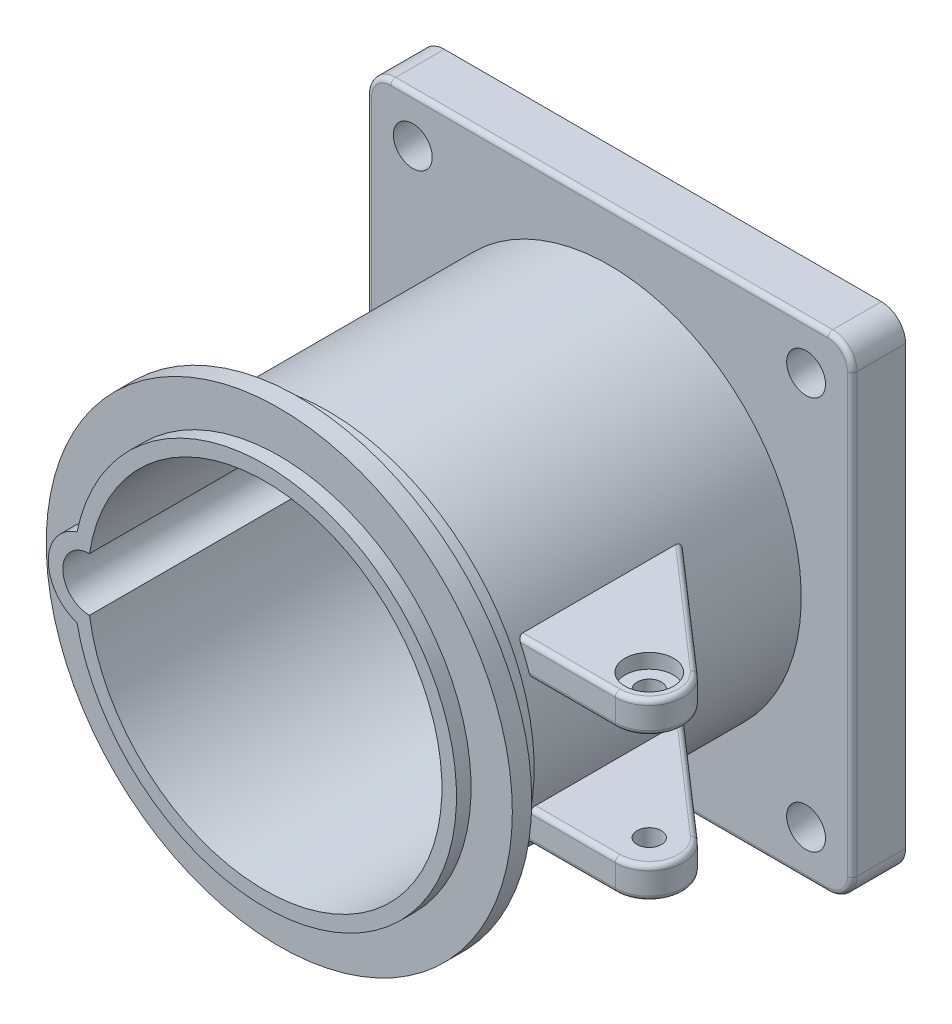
ISO-10303-21;
HEADER;
FILE_DESCRIPTION(('STEP AP214'),'2;1');
FILE_NAME('part.step','',(''),(''),'','','');
FILE_SCHEMA(('AUTOMOTIVE_DESIGN { 1 0 10303 214 1 1 1 1 }'));
ENDSEC;
DATA;
#1=APPLICATION_CONTEXT('core data for automotive mechanical design processes');
#2=APPLICATION_PROTOCOL_DEFINITION('international standard','automotive_design',2000,#1);
#3=PRODUCT_CONTEXT('',#1,'mechanical');
#4=PRODUCT('Part','Part','',(#3));
#5=PRODUCT_RELATED_PRODUCT_CATEGORY('part','',(#4));
#6=PRODUCT_DEFINITION_FORMATION('','',#4);
#7=PRODUCT_DEFINITION_CONTEXT('part definition',#1,'design');
#8=PRODUCT_DEFINITION('design','',#6,#7);
#9=PRODUCT_DEFINITION_SHAPE('','',#8);
#10=(LENGTH_UNIT() NAMED_UNIT(*) SI_UNIT(.MILLI.,.METRE.));
#11=(NAMED_UNIT(*) PLANE_ANGLE_UNIT() SI_UNIT($,.RADIAN.));
#12=(NAMED_UNIT(*) SI_UNIT($,.STERADIAN.) SOLID_ANGLE_UNIT());
#13=UNCERTAINTY_MEASURE_WITH_UNIT(LENGTH_MEASURE(1.E-05),#10,'distance_accuracy_value','');
#14=(GEOMETRIC_REPRESENTATION_CONTEXT(3) GLOBAL_UNCERTAINTY_ASSIGNED_CONTEXT((#13)) GLOBAL_UNIT_ASSIGNED_CONTEXT((#10,
#11,#12)) REPRESENTATION_CONTEXT('',''));
#15=CARTESIAN_POINT('',(0.,0.,0.));
#16=DIRECTION('',(0.,0.,1.));
#17=DIRECTION('',(1.,0.,0.));
#18=AXIS2_PLACEMENT_3D('',#15,#16,#17);
#19=CARTESIAN_POINT('',(0.,0.,-25.));
#20=DIRECTION('',(0.,0.,1.));
#21=DIRECTION('',(1.,0.,0.));
#22=AXIS2_PLACEMENT_3D('',#19,#20,#21);
#23=CYLINDRICAL_SURFACE('',#22,36.5);
#24=DIRECTION('',(0.,0.,1.));
#25=VECTOR('',#24,1.);
#26=CARTESIAN_POINT('',(-36.0832378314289,-5.49999523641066,46.5));
#27=LINE('',#26,#25);
#28=CARTESIAN_POINT('',(-36.0832378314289,-5.49999523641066,11.));
#29=VERTEX_POINT('',#28);
#30=CARTESIAN_POINT('',(-36.0832378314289,-5.49999523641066,82.));
#31=VERTEX_POINT('',#30);
#32=EDGE_CURVE('E282',#29,#31,#27,.T.);
#33=ORIENTED_EDGE('',*,*,#32,.T.);
#34=CARTESIAN_POINT('',(0.,0.,82.));
#35=DIRECTION('',(0.,0.,1.));
#36=DIRECTION('',(1.,0.,0.));
#37=AXIS2_PLACEMENT_3D('',#34,#35,#36);
#38=CIRCLE('',#37,36.5);
#39=CARTESIAN_POINT('',(-36.0832378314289,5.49999523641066,82.));
#40=VERTEX_POINT('',#39);
#41=EDGE_CURVE('E332',#31,#40,#38,.T.);
#42=ORIENTED_EDGE('',*,*,#41,.T.);
#43=DIRECTION('',(0.,0.,1.));
#44=VECTOR('',#43,1.);
#45=CARTESIAN_POINT('',(-36.0832378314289,5.49999523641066,46.5));
#46=LINE('',#45,#44);
#47=CARTESIAN_POINT('',(-36.0832378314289,5.49999523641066,11.));
#48=VERTEX_POINT('',#47);
#49=EDGE_CURVE('E288',#40,#48,#46,.F.);
#50=ORIENTED_EDGE('',*,*,#49,.T.);
#51=CARTESIAN_POINT('',(0.,0.,11.));
#52=DIRECTION('',(0.,0.,-1.));
#53=DIRECTION('',(-1.,0.,0.));
#54=AXIS2_PLACEMENT_3D('',#51,#52,#53);
#55=CIRCLE('',#54,36.5);
#56=EDGE_CURVE('E275',#48,#29,#55,.F.);
#57=ORIENTED_EDGE('',*,*,#56,.T.);
#58=EDGE_LOOP('',(#33,#42,#50,#57));
#59=FACE_BOUND('',#58,.T.);
#60=CARTESIAN_POINT('',(0.,0.,3.));
#61=DIRECTION('',(0.,0.,-1.));
#62=DIRECTION('',(-1.,0.,0.));
#63=AXIS2_PLACEMENT_3D('',#60,#61,#62);
#64=CIRCLE('',#63,36.5);
#65=CARTESIAN_POINT('',(-36.5,0.,3.));
#66=VERTEX_POINT('',#65);
#67=EDGE_CURVE('E11',#66,#66,#64,.F.);
#68=ORIENTED_EDGE('',*,*,#67,.F.);
#69=EDGE_LOOP('',(#68));
#70=FACE_BOUND('',#69,.T.);
#71=ADVANCED_FACE('F35',(#59,#70),#23,.F.);
#72=CARTESIAN_POINT('',(55.1998225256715,26.,58.));
#73=DIRECTION('',(0.,-1.,0.));
#74=DIRECTION('',(0.,0.,-1.));
#75=AXIS2_PLACEMENT_3D('',#72,#73,#74);
#76=CYLINDRICAL_SURFACE('',#75,2.5);
#77=CARTESIAN_POINT('',(55.1998225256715,11.5,58.));
#78=DIRECTION('',(0.,1.,0.));
#79=DIRECTION('',(0.,0.,1.));
#80=AXIS2_PLACEMENT_3D('',#77,#78,#79);
#81=CIRCLE('',#80,2.5);
#82=CARTESIAN_POINT('',(55.1998225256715,11.5,60.5));
#83=VERTEX_POINT('',#82);
#84=EDGE_CURVE('E407',#83,#83,#81,.T.);
#85=ORIENTED_EDGE('',*,*,#84,.F.);
#86=EDGE_LOOP('',(#85));
#87=FACE_BOUND('',#86,.T.);
#88=CARTESIAN_POINT('',(55.1998225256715,15.,58.));
#89=DIRECTION('',(0.,1.,0.));
#90=DIRECTION('',(0.,0.,1.));
#91=AXIS2_PLACEMENT_3D('',#88,#89,#90);
#92=CIRCLE('',#91,2.5);
#93=CARTESIAN_POINT('',(55.1998225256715,15.,60.5));
#94=VERTEX_POINT('',#93);
#95=EDGE_CURVE('E415',#94,#94,#92,.F.);
#96=ORIENTED_EDGE('',*,*,#95,.F.);
#97=EDGE_LOOP('',(#96));
#98=FACE_BOUND('',#97,.T.);
#99=ADVANCED_FACE('F708',(#87,#98),#76,.F.);
#100=CARTESIAN_POINT('',(55.1998225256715,-11.5,58.));
#101=DIRECTION('',(0.,-1.,0.));
#102=DIRECTION('',(0.,0.,-1.));
#103=AXIS2_PLACEMENT_3D('',#100,#101,#102);
#104=CIRCLE('',#103,2.5);
#105=CARTESIAN_POINT('',(55.1998225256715,-11.5,55.5));
#106=VERTEX_POINT('',#105);
#107=EDGE_CURVE('E410',#106,#106,#104,.T.);
#108=ORIENTED_EDGE('',*,*,#107,.F.);
#109=EDGE_LOOP('',(#108));
#110=FACE_BOUND('',#109,.T.);
#111=CARTESIAN_POINT('',(55.1998225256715,-15.,58.));
#112=DIRECTION('',(0.,-1.,0.));
#113=DIRECTION('',(0.,0.,-1.));
#114=AXIS2_PLACEMENT_3D('',#111,#112,#113);
#115=CIRCLE('',#114,2.5);
#116=CARTESIAN_POINT('',(55.1998225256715,-15.,55.5));
#117=VERTEX_POINT('',#116);
#118=EDGE_CURVE('E411',#117,#117,#115,.F.);
#119=ORIENTED_EDGE('',*,*,#118,.F.);
#120=EDGE_LOOP('',(#119));
#121=FACE_BOUND('',#120,.T.);
#122=ADVANCED_FACE('F715',(#110,#121),#76,.F.);
#123=CARTESIAN_POINT('',(55.1998225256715,-18.,65.0000075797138));
#124=DIRECTION('',(0.,0.,1.));
#125=DIRECTION('',(1.,0.,0.));
#126=AXIS2_PLACEMENT_3D('',#123,#124,#125);
#127=PLANE('',#126);
#128=CARTESIAN_POINT('',(0.,0.,65.0000075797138));
#129=DIRECTION('',(0.,0.,1.));
#130=DIRECTION('',(1.,0.,0.));
#131=AXIS2_PLACEMENT_3D('',#128,#129,#130);
#132=CIRCLE('',#131,39.5);
#133=CARTESIAN_POINT('',(35.6545929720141,-17.,65.0000075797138));
#134=VERTEX_POINT('',#133);
#135=CARTESIAN_POINT('',(37.4699879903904,-12.5,65.0000075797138));
#136=VERTEX_POINT('',#135);
#137=EDGE_CURVE('E589',#134,#136,#132,.T.);
#138=ORIENTED_EDGE('',*,*,#137,.F.);
#139=DIRECTION('',(1.,0.,0.));
#140=VECTOR('',#139,1.);
#141=CARTESIAN_POINT('',(55.1998225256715,-17.,65.0000075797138));
#142=LINE('',#141,#140);
#143=CARTESIAN_POINT('',(55.1998225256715,-17.,65.0000075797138));
#144=VERTEX_POINT('',#143);
#145=EDGE_CURVE('E453',#134,#144,#142,.T.);
#146=ORIENTED_EDGE('',*,*,#145,.T.);
#147=DIRECTION('',(0.,1.,0.));
#148=VECTOR('',#147,1.);
#149=CARTESIAN_POINT('',(55.1998225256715,-18.,65.0000075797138));
#150=LINE('',#149,#148);
#151=CARTESIAN_POINT('',(55.1998225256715,-12.5,65.0000075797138));
#152=VERTEX_POINT('',#151);
#153=EDGE_CURVE('E622',#144,#152,#150,.T.);
#154=ORIENTED_EDGE('',*,*,#153,.T.);
#155=DIRECTION('',(1.,0.,0.));
#156=VECTOR('',#155,1.);
#157=CARTESIAN_POINT('',(37.7888872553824,-12.5,65.0000075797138));
#158=LINE('',#157,#156);
#159=EDGE_CURVE('E451',#152,#136,#158,.F.);
#160=ORIENTED_EDGE('',*,*,#159,.T.);
#161=EDGE_LOOP('',(#138,#146,#154,#160));
#162=FACE_BOUND('',#161,.T.);
#163=ADVANCED_FACE('F942',(#162),#127,.T.);
#164=CARTESIAN_POINT('',(39.5,-18.,35.));
#165=DIRECTION('',(0.657690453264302,0.,-0.753288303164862));
#166=DIRECTION('',(-0.753288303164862,0.,-0.657690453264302));
#167=AXIS2_PLACEMENT_3D('',#164,#165,#166);
#168=PLANE('',#167);
#169=DIRECTION('',(0.,1.,0.));
#170=VECTOR('',#169,1.);
#171=CARTESIAN_POINT('',(59.8036606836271,-18.,52.7269761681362));
#172=LINE('',#171,#170);
#173=CARTESIAN_POINT('',(59.8036606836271,-17.,52.7269761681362));
#174=VERTEX_POINT('',#173);
#175=CARTESIAN_POINT('',(59.8036606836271,-12.5,52.7269761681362));
#176=VERTEX_POINT('',#175);
#177=EDGE_CURVE('E612',#174,#176,#172,.T.);
#178=ORIENTED_EDGE('',*,*,#177,.F.);
#179=DIRECTION('',(-0.753288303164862,0.,-0.657690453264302));
#180=VECTOR('',#179,1.);
#181=CARTESIAN_POINT('',(35.1603469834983,-17.,31.2110810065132));
#182=LINE('',#181,#180);
#183=CARTESIAN_POINT('',(35.6545929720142,-17.,31.6426035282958));
#184=VERTEX_POINT('',#183);
#185=EDGE_CURVE('E51',#174,#184,#182,.T.);
#186=ORIENTED_EDGE('',*,*,#185,.T.);
#187=CARTESIAN_POINT('',(0.,0.,0.512841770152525));
#188=DIRECTION('',(0.657690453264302,0.,-0.753288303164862));
#189=DIRECTION('',(-0.753288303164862,0.,-0.657690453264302));
#190=AXIS2_PLACEMENT_3D('',#187,#188,#189);
#191=ELLIPSE('',#190,52.4367627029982,39.5);
#192=CARTESIAN_POINT('',(37.4699879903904,-12.5,33.2276115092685));
#193=VERTEX_POINT('',#192);
#194=EDGE_CURVE('E613',#193,#184,#191,.T.);
#195=ORIENTED_EDGE('',*,*,#194,.F.);
#196=DIRECTION('',(-0.753288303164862,0.,-0.657690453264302));
#197=VECTOR('',#196,1.);
#198=CARTESIAN_POINT('',(59.8036606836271,-12.5,52.7269761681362));
#199=LINE('',#198,#197);
#200=EDGE_CURVE('E501',#193,#176,#199,.F.);
#201=ORIENTED_EDGE('',*,*,#200,.T.);
#202=EDGE_LOOP('',(#178,#186,#195,#201));
#203=FACE_BOUND('',#202,.T.);
#204=ADVANCED_FACE('F611',(#203),#168,.T.);
#205=CARTESIAN_POINT('',(55.1998225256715,-18.,58.));
#206=DIRECTION('',(0.,1.,0.));
#207=DIRECTION('',(0.,0.,1.));
#208=AXIS2_PLACEMENT_3D('',#205,#206,#207);
#209=CYLINDRICAL_SURFACE('',#208,7.00000757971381);
#210=ORIENTED_EDGE('',*,*,#153,.F.);
#211=CARTESIAN_POINT('',(55.1998225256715,-17.,58.));
#212=DIRECTION('',(0.,1.,0.));
#213=DIRECTION('',(0.,0.,1.));
#214=AXIS2_PLACEMENT_3D('',#211,#212,#213);
#215=CIRCLE('',#214,7.00000757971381);
#216=EDGE_CURVE('E464',#144,#174,#215,.T.);
#217=ORIENTED_EDGE('',*,*,#216,.T.);
#218=ORIENTED_EDGE('',*,*,#177,.T.);
#219=CARTESIAN_POINT('',(55.1998225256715,-12.5,58.));
#220=DIRECTION('',(0.,-1.,0.));
#221=DIRECTION('',(0.,0.,-1.));
#222=AXIS2_PLACEMENT_3D('',#219,#220,#221);
#223=CIRCLE('',#222,7.00000757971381);
#224=EDGE_CURVE('E462',#176,#152,#223,.T.);
#225=ORIENTED_EDGE('',*,*,#224,.T.);
#226=EDGE_LOOP('',(#210,#217,#218,#225));
#227=FACE_BOUND('',#226,.T.);
#228=ADVANCED_FACE('F616',(#227),#209,.T.);
#229=CARTESIAN_POINT('',(0.,0.,82.));
#230=DIRECTION('',(0.,0.,-1.));
#231=DIRECTION('',(-1.,0.,0.));
#232=AXIS2_PLACEMENT_3D('',#229,#230,#231);
#233=CYLINDRICAL_SURFACE('',#232,39.5);
#234=DIRECTION('',(0.,0.,1.));
#235=VECTOR('',#234,1.);
#236=CARTESIAN_POINT('',(37.7888872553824,-11.5,21.0000075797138));
#237=LINE('',#236,#235);
#238=CARTESIAN_POINT('',(37.7888872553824,-11.5,34.8335530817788));
#239=VERTEX_POINT('',#238);
#240=CARTESIAN_POINT('',(37.7888872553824,-11.5,64.0000075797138));
#241=VERTEX_POINT('',#240);
#242=EDGE_CURVE('E587',#239,#241,#237,.T.);
#243=ORIENTED_EDGE('',*,*,#242,.F.);
#244=CARTESIAN_POINT('',(37.7888872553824,-11.5,34.8335530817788));
#245=CARTESIAN_POINT('',(37.7888852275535,-11.5000056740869,34.7913141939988));
#246=CARTESIAN_POINT('',(37.788425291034,-11.5015181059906,34.7490963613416));
#247=CARTESIAN_POINT('',(37.7866284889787,-11.507420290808,34.6649006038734));
#248=CARTESIAN_POINT('',(37.7852920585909,-11.5118086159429,34.6229225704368));
#249=CARTESIAN_POINT('',(37.7800254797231,-11.5290860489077,34.4975790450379));
#250=CARTESIAN_POINT('',(37.7748380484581,-11.5460875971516,34.4148067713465));
#251=CARTESIAN_POINT('',(37.7598542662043,-11.5950075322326,34.2349808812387));
#252=CARTESIAN_POINT('',(37.7493112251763,-11.6293329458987,34.138643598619));
#253=CARTESIAN_POINT('',(37.7236421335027,-11.7123317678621,33.9527844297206));
#254=CARTESIAN_POINT('',(37.7085096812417,-11.7610252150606,33.863272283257));
#255=CARTESIAN_POINT('',(37.6768334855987,-11.8620600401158,33.7101026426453));
#256=CARTESIAN_POINT('',(37.6610734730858,-11.9120453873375,33.6447305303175));
#257=CARTESIAN_POINT('',(37.6264470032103,-12.0209707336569,33.523322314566));
#258=CARTESIAN_POINT('',(37.6075963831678,-12.0798649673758,33.4672414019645));
#259=CARTESIAN_POINT('',(37.5698979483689,-12.1965528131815,33.3751695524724));
#260=CARTESIAN_POINT('',(37.5515128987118,-12.2530717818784,33.3374074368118));
#261=CARTESIAN_POINT('',(37.5222464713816,-12.3422855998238,33.2892272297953));
#262=CARTESIAN_POINT('',(37.5121500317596,-12.3729414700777,33.2745213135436));
#263=CARTESIAN_POINT('',(37.4914408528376,-12.4355521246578,33.2484429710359));
#264=CARTESIAN_POINT('',(37.4808270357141,-12.4675095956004,33.2370778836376));
#265=CARTESIAN_POINT('',(37.4699879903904,-12.5,33.2276115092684));
#266=B_SPLINE_CURVE_WITH_KNOTS('',3,(#244,#245,#246,#247,#248,#249,#250,#251,#252,#253,#254,
#255,#256,#257,#258,#259,#260,#261,#262,#263,#264,#265),.UNSPECIFIED.,.F.,.F.,(4,2,2,2,2,2,2,2,
2,2,4),(0.,0.126651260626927,0.253239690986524,0.506424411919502,0.813573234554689,
1.12115247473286,1.37162215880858,1.62084631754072,1.83100313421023,1.93724128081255,
2.04371108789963),.UNSPECIFIED.);
#267=EDGE_CURVE('E58',#239,#193,#266,.T.);
#268=ORIENTED_EDGE('',*,*,#267,.T.);
#269=ORIENTED_EDGE('',*,*,#194,.T.);
#270=CARTESIAN_POINT('',(35.6545929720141,-17.,31.6426035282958));
#271=CARTESIAN_POINT('',(35.6346602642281,-17.0418111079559,31.6251854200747));
#272=CARTESIAN_POINT('',(35.6140907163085,-17.0847574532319,31.6107276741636));
#273=CARTESIAN_POINT('',(35.571852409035,-17.1725264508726,31.5889372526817));
#274=CARTESIAN_POINT('',(35.5501735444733,-17.2173652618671,31.5816906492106));
#275=CARTESIAN_POINT('',(35.5062228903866,-17.3078215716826,31.5759816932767));
#276=CARTESIAN_POINT('',(35.4839479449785,-17.3534423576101,31.5775833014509));
#277=CARTESIAN_POINT('',(35.4399035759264,-17.4432138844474,31.5909130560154));
#278=CARTESIAN_POINT('',(35.4181320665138,-17.4873712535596,31.6025862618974));
#279=CARTESIAN_POINT('',(35.3791565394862,-17.5660732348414,31.6338209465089));
#280=CARTESIAN_POINT('',(35.3617508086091,-17.601078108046,31.6519752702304));
#281=CARTESIAN_POINT('',(35.328660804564,-17.6674022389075,31.6953140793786));
#282=CARTESIAN_POINT('',(35.3129779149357,-17.6987185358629,31.7205041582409));
#283=CARTESIAN_POINT('',(35.2852634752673,-17.7539022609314,31.7740238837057));
#284=CARTESIAN_POINT('',(35.2730253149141,-17.7781975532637,31.8018121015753));
#285=CARTESIAN_POINT('',(35.2505442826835,-17.8227312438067,31.8611348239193));
#286=CARTESIAN_POINT('',(35.2403007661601,-17.8429709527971,31.8926681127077));
#287=CARTESIAN_POINT('',(35.2181076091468,-17.8867472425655,31.9717582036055));
#288=CARTESIAN_POINT('',(35.2071266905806,-17.9083399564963,32.0206617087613));
#289=CARTESIAN_POINT('',(35.1888342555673,-17.9442566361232,32.1218513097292));
#290=CARTESIAN_POINT('',(35.1815386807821,-17.9585490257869,32.1741510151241));
#291=CARTESIAN_POINT('',(35.1704633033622,-17.9802297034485,32.2784839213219));
#292=CARTESIAN_POINT('',(35.166566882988,-17.9878470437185,32.3304595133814));
#293=CARTESIAN_POINT('',(35.1615266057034,-17.9976954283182,32.4345262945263));
#294=CARTESIAN_POINT('',(35.1603548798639,-17.9999810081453,32.4866108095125));
#295=CARTESIAN_POINT('',(35.1603469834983,-18.,32.538593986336));
#296=B_SPLINE_CURVE_WITH_KNOTS('',3,(#270,#271,#272,#273,#274,#275,#276,#277,#278,#279,#280,
#281,#282,#283,#284,#285,#286,#287,#288,#289,#290,#291,#292,#293,#294,#295),.UNSPECIFIED.,.F.,
.F.,(4,2,2,2,2,2,2,2,2,2,2,2,4),(0.,0.148621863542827,0.298997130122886,0.450460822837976,
0.601103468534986,0.729663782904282,0.858326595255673,0.974511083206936,1.09065795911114,
1.25348147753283,1.41700341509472,1.5746656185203,1.73070797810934),.UNSPECIFIED.);
#297=CARTESIAN_POINT('',(35.1603469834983,-18.,32.538593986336));
#298=VERTEX_POINT('',#297);
#299=EDGE_CURVE('E543',#184,#298,#296,.T.);
#300=ORIENTED_EDGE('',*,*,#299,.T.);
#301=DIRECTION('',(0.,0.,-1.));
#302=VECTOR('',#301,1.);
#303=CARTESIAN_POINT('',(35.1603469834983,-18.,82.));
#304=LINE('',#303,#302);
#305=CARTESIAN_POINT('',(35.1603469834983,-18.,64.0000075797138));
#306=VERTEX_POINT('',#305);
#307=EDGE_CURVE('E630',#306,#298,#304,.T.);
#308=ORIENTED_EDGE('',*,*,#307,.F.);
#309=CARTESIAN_POINT('',(35.1603469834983,-18.,64.0000075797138));
#310=CARTESIAN_POINT('',(35.1603461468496,-18.0000012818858,64.0259646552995));
#311=CARTESIAN_POINT('',(35.1608647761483,-17.99898860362,64.0519083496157));
#312=CARTESIAN_POINT('',(35.1629276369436,-17.9949583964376,64.1035910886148));
#313=CARTESIAN_POINT('',(35.1644715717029,-17.9919414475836,64.1293301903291));
#314=CARTESIAN_POINT('',(35.1706028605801,-17.9799549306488,64.2057603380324));
#315=CARTESIAN_POINT('',(35.1766899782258,-17.9680491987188,64.2559071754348));
#316=CARTESIAN_POINT('',(35.1925572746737,-17.9369510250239,64.3531844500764));
#317=CARTESIAN_POINT('',(35.2023349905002,-17.9177634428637,64.4003168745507));
#318=CARTESIAN_POINT('',(35.2251455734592,-17.8728775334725,64.490543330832));
#319=CARTESIAN_POINT('',(35.2381807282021,-17.8471746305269,64.5336344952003));
#320=CARTESIAN_POINT('',(35.2676451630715,-17.7888817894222,64.6167390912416));
#321=CARTESIAN_POINT('',(35.2842013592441,-17.7560327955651,64.6565249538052));
#322=CARTESIAN_POINT('',(35.3197126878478,-17.6852894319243,64.7300652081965));
#323=CARTESIAN_POINT('',(35.3386684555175,-17.6473937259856,64.7638179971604));
#324=CARTESIAN_POINT('',(35.3804825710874,-17.5634241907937,64.828034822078));
#325=CARTESIAN_POINT('',(35.4035417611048,-17.5169097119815,64.8577915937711));
#326=CARTESIAN_POINT('',(35.4512037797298,-17.4202486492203,64.909066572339));
#327=CARTESIAN_POINT('',(35.4758076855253,-17.3700995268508,64.9305789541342));
#328=CARTESIAN_POINT('',(35.5259891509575,-17.267233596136,64.9651699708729));
#329=CARTESIAN_POINT('',(35.5515695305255,-17.214509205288,64.9782218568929));
#330=CARTESIAN_POINT('',(35.6030088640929,-17.1078737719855,64.9956396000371));
#331=CARTESIAN_POINT('',(35.6288673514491,-17.0539645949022,65.0000182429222));
#332=CARTESIAN_POINT('',(35.6545929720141,-17.,65.0000075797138));
#333=B_SPLINE_CURVE_WITH_KNOTS('',3,(#309,#310,#311,#312,#313,#314,#315,#316,#317,#318,#319,
#320,#321,#322,#323,#324,#325,#326,#327,#328,#329,#330,#331,#332),.UNSPECIFIED.,.F.,.F.,(4,2,2,
2,2,2,2,2,2,2,2,4),(0.,0.0778201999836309,0.15561788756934,0.310494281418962,0.465267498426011,
0.620149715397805,0.782041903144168,0.943977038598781,1.12275600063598,1.30166104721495,
1.48112900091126,1.66033219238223),.UNSPECIFIED.);
#334=EDGE_CURVE('E504',#306,#134,#333,.T.);
#335=ORIENTED_EDGE('',*,*,#334,.T.);
#336=ORIENTED_EDGE('',*,*,#137,.T.);
#337=CARTESIAN_POINT('',(37.4699879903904,-12.5,65.0000075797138));
#338=CARTESIAN_POINT('',(37.4894121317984,-12.4417918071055,65.0000462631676));
#339=CARTESIAN_POINT('',(37.5086938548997,-12.3835239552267,64.9949265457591));
#340=CARTESIAN_POINT('',(37.5464837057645,-12.2684601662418,64.9745771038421));
#341=CARTESIAN_POINT('',(37.5649910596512,-12.2116657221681,64.9593375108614));
#342=CARTESIAN_POINT('',(37.6007247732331,-12.1011943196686,64.9189318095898));
#343=CARTESIAN_POINT('',(37.6179495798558,-12.0475211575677,64.8937538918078));
#344=CARTESIAN_POINT('',(37.6505979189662,-11.9450976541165,64.834029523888));
#345=CARTESIAN_POINT('',(37.6660227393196,-11.8963437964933,64.7994898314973));
#346=CARTESIAN_POINT('',(37.6942059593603,-11.8067347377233,64.7230225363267));
#347=CARTESIAN_POINT('',(37.7070294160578,-11.7656894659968,64.6813419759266));
#348=CARTESIAN_POINT('',(37.7301854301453,-11.6912203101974,64.5910224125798));
#349=CARTESIAN_POINT('',(37.7405177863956,-11.657797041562,64.542382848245));
#350=CARTESIAN_POINT('',(37.7579464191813,-11.6012206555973,64.4420041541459));
#351=CARTESIAN_POINT('',(37.7651714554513,-11.5776602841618,64.390516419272));
#352=CARTESIAN_POINT('',(37.776840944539,-11.5395273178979,64.284048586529));
#353=CARTESIAN_POINT('',(37.7812889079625,-11.5249433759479,64.2290729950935));
#354=CARTESIAN_POINT('',(37.7858156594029,-11.5100894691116,64.1446563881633));
#355=CARTESIAN_POINT('',(37.7869673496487,-11.5063073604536,64.1158470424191));
#356=CARTESIAN_POINT('',(37.7885025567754,-11.5012641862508,64.0580326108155));
#357=CARTESIAN_POINT('',(37.7888872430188,-11.4999992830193,64.0290278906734));
#358=CARTESIAN_POINT('',(37.7888872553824,-11.5,64.0000075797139));
#359=B_SPLINE_CURVE_WITH_KNOTS('',3,(#337,#338,#339,#340,#341,#342,#343,#344,#345,#346,#347,
#348,#349,#350,#351,#352,#353,#354,#355,#356,#357,#358),.UNSPECIFIED.,.F.,.F.,(4,2,2,2,2,2,2,2,
2,2,4),(0.,0.183897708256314,0.367975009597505,0.552271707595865,0.736435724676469,
0.915185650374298,1.0939500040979,1.26435279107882,1.43453972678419,1.52167280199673,
1.6086729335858),.UNSPECIFIED.);
#360=EDGE_CURVE('E511',#136,#241,#359,.T.);
#361=ORIENTED_EDGE('',*,*,#360,.T.);
#362=EDGE_LOOP('',(#243,#268,#269,#300,#308,#335,#336,#361));
#363=FACE_BOUND('',#362,.T.);
#364=DIRECTION('',(0.,0.,-1.));
#365=VECTOR('',#364,1.);
#366=CARTESIAN_POINT('',(35.1603469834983,18.,82.));
#367=LINE('',#366,#365);
#368=CARTESIAN_POINT('',(35.1603469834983,18.,64.0000075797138));
#369=VERTEX_POINT('',#368);
#370=CARTESIAN_POINT('',(35.1603469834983,18.,32.538593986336));
#371=VERTEX_POINT('',#370);
#372=EDGE_CURVE('E627',#369,#371,#367,.T.);
#373=ORIENTED_EDGE('',*,*,#372,.T.);
#374=CARTESIAN_POINT('',(35.1603469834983,18.,32.538593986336));
#375=CARTESIAN_POINT('',(35.1603592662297,17.9999628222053,32.4697526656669));
#376=CARTESIAN_POINT('',(35.1624199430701,17.9959490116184,32.4004831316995));
#377=CARTESIAN_POINT('',(35.1715047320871,17.9781950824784,32.2627139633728));
#378=CARTESIAN_POINT('',(35.1785900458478,17.9643350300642,32.1942345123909));
#379=CARTESIAN_POINT('',(35.1955723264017,17.9310315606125,32.0817644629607));
#380=CARTESIAN_POINT('',(35.2039504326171,17.9145847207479,32.0366803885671));
#381=CARTESIAN_POINT('',(35.2237631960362,17.8755976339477,31.9501142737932));
#382=CARTESIAN_POINT('',(35.2351842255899,17.853084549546,31.9086172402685));
#383=CARTESIAN_POINT('',(35.2591368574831,17.8057252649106,31.8369081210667));
#384=CARTESIAN_POINT('',(35.2712163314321,17.7817927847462,31.8059457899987));
#385=CARTESIAN_POINT('',(35.2974903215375,17.7295806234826,31.7489153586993));
#386=CARTESIAN_POINT('',(35.3116852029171,17.7013001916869,31.7228481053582));
#387=CARTESIAN_POINT('',(35.3418951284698,17.6409066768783,31.6766405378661));
#388=CARTESIAN_POINT('',(35.3579162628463,17.6087807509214,31.6565209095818));
#389=CARTESIAN_POINT('',(35.3911936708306,17.5418016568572,31.6230389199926));
#390=CARTESIAN_POINT('',(35.4084492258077,17.5069500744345,31.609672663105));
#391=CARTESIAN_POINT('',(35.4426488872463,17.4376045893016,31.5903329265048));
#392=CARTESIAN_POINT('',(35.4595597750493,17.4031923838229,31.5840002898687));
#393=CARTESIAN_POINT('',(35.4935370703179,17.3337914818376,31.577139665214));
#394=CARTESIAN_POINT('',(35.5106037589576,17.2988015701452,31.576626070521));
#395=CARTESIAN_POINT('',(35.5495035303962,17.2187486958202,31.5815095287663));
#396=CARTESIAN_POINT('',(35.5712547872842,17.1737645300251,31.5886980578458));
#397=CARTESIAN_POINT('',(35.6137517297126,17.0854655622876,31.61048562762));
#398=CARTESIAN_POINT('',(35.6345028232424,17.0421421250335,31.6250383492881));
#399=CARTESIAN_POINT('',(35.6545929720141,17.,31.6426035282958));
#400=B_SPLINE_CURVE_WITH_KNOTS('',3,(#374,#375,#376,#377,#378,#379,#380,#381,#382,#383,#384,
#385,#386,#387,#388,#389,#390,#391,#392,#393,#394,#395,#396,#397,#398,#399),.UNSPECIFIED.,.F.,
.F.,(4,2,2,2,2,2,2,2,2,2,2,2,4),(0.,0.207076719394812,0.416720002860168,0.562357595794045,
0.707353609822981,0.829701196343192,0.95206993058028,1.07485938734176,1.19757793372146,
1.3136918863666,1.43009298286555,1.58089121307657,1.73075253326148),.UNSPECIFIED.);
#401=CARTESIAN_POINT('',(35.6545929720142,17.,31.6426035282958));
#402=VERTEX_POINT('',#401);
#403=EDGE_CURVE('E549',#371,#402,#400,.T.);
#404=ORIENTED_EDGE('',*,*,#403,.T.);
#405=CARTESIAN_POINT('',(37.4699879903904,12.5,33.2276115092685));
#406=VERTEX_POINT('',#405);
#407=EDGE_CURVE('E634',#402,#406,#191,.T.);
#408=ORIENTED_EDGE('',*,*,#407,.T.);
#409=CARTESIAN_POINT('',(37.4699879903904,12.5,33.2276115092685));
#410=CARTESIAN_POINT('',(37.4902097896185,12.4393877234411,33.2453239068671));
#411=CARTESIAN_POINT('',(37.5095851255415,12.3808138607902,33.2694809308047));
#412=CARTESIAN_POINT('',(37.5463054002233,12.2689994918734,33.327961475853));
#413=CARTESIAN_POINT('',(37.5636680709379,12.2157131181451,33.3621850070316));
#414=CARTESIAN_POINT('',(37.6009078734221,12.1006753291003,33.4489682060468));
#415=CARTESIAN_POINT('',(37.6201702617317,12.0406055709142,33.5039825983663));
#416=CARTESIAN_POINT('',(37.6555971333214,11.9293515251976,33.6236153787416));
#417=CARTESIAN_POINT('',(37.6717450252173,11.8782149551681,33.6882821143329));
#418=CARTESIAN_POINT('',(37.7045518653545,11.7737198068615,33.8415354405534));
#419=CARTESIAN_POINT('',(37.7203439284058,11.7229567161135,33.9320763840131));
#420=CARTESIAN_POINT('',(37.7471558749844,11.6363342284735,34.1204591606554));
#421=CARTESIAN_POINT('',(37.7581818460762,11.6004558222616,34.2182914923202));
#422=CARTESIAN_POINT('',(37.7739771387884,11.5489067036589,34.4020897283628));
#423=CARTESIAN_POINT('',(37.7794813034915,11.5308699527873,34.4873290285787));
#424=CARTESIAN_POINT('',(37.785070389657,11.5125363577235,34.6164706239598));
#425=CARTESIAN_POINT('',(37.7864888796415,11.5078787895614,34.6597254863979));
#426=CARTESIAN_POINT('',(37.7883964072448,11.5016130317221,34.7464967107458));
#427=CARTESIAN_POINT('',(37.7888849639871,11.5000064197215,34.7900131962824));
#428=CARTESIAN_POINT('',(37.7888872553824,11.5,34.8335530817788));
#429=B_SPLINE_CURVE_WITH_KNOTS('',3,(#409,#410,#411,#412,#413,#414,#415,#416,#417,#418,#419,
#420,#421,#422,#423,#424,#425,#426,#427,#428),.UNSPECIFIED.,.F.,.F.,(4,2,2,2,2,2,2,2,2,4),(0.,
0.197985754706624,0.394067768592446,0.643881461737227,0.894991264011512,1.20839194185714,
1.52139113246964,1.78242390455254,1.91290397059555,2.04345149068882),.UNSPECIFIED.);
#430=CARTESIAN_POINT('',(37.7888872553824,11.5,34.8335530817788));
#431=VERTEX_POINT('',#430);
#432=EDGE_CURVE('E559',#406,#431,#429,.T.);
#433=ORIENTED_EDGE('',*,*,#432,.T.);
#434=DIRECTION('',(0.,0.,1.));
#435=VECTOR('',#434,1.);
#436=CARTESIAN_POINT('',(37.7888872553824,11.5,21.0000075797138));
#437=LINE('',#436,#435);
#438=CARTESIAN_POINT('',(37.7888872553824,11.5,64.0000075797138));
#439=VERTEX_POINT('',#438);
#440=EDGE_CURVE('E597',#431,#439,#437,.T.);
#441=ORIENTED_EDGE('',*,*,#440,.T.);
#442=CARTESIAN_POINT('',(37.7888872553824,11.5,64.0000075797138));
#443=CARTESIAN_POINT('',(37.7888872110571,11.4999995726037,64.0272374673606));
#444=CARTESIAN_POINT('',(37.7885485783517,11.501112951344,64.0544540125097));
#445=CARTESIAN_POINT('',(37.7871977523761,11.505550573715,64.1086859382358));
#446=CARTESIAN_POINT('',(37.7861856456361,11.5088745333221,64.135701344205));
#447=CARTESIAN_POINT('',(37.7821518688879,11.5221131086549,64.2160460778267));
#448=CARTESIAN_POINT('',(37.7781326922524,11.5352946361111,64.2688266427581));
#449=CARTESIAN_POINT('',(37.7675457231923,11.5699098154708,64.3713055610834));
#450=CARTESIAN_POINT('',(37.7609777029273,11.5913442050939,64.4210036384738));
#451=CARTESIAN_POINT('',(37.7454717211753,11.6417377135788,64.5160283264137));
#452=CARTESIAN_POINT('',(37.7365334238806,11.6706978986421,64.5613543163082));
#453=CARTESIAN_POINT('',(37.7163474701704,11.7357705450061,64.6472377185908));
#454=CARTESIAN_POINT('',(37.7050624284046,11.7719984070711,64.6876987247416));
#455=CARTESIAN_POINT('',(37.6805714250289,11.8501566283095,64.7619864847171));
#456=CARTESIAN_POINT('',(37.6673650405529,11.8920882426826,64.7958117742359));
#457=CARTESIAN_POINT('',(37.6387749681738,11.9822762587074,64.8573669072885));
#458=CARTESIAN_POINT('',(37.6233238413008,12.030722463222,64.8847869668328));
#459=CARTESIAN_POINT('',(37.5910746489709,12.131112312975,64.9311244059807));
#460=CARTESIAN_POINT('',(37.5742763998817,12.1830564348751,64.9500406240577));
#461=CARTESIAN_POINT('',(37.5429644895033,12.2791640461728,64.9763434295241));
#462=CARTESIAN_POINT('',(37.5286067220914,12.3229786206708,64.9852197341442));
#463=CARTESIAN_POINT('',(37.4995230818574,12.4112029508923,64.9970518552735));
#464=CARTESIAN_POINT('',(37.4847978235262,12.455611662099,65.0000169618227));
#465=CARTESIAN_POINT('',(37.4699879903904,12.5,65.0000075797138));
#466=B_SPLINE_CURVE_WITH_KNOTS('',3,(#442,#443,#444,#445,#446,#447,#448,#449,#450,#451,#452,
#453,#454,#455,#456,#457,#458,#459,#460,#461,#462,#463,#464,#465),.UNSPECIFIED.,.F.,.F.,(4,2,2,
2,2,2,2,2,2,2,2,4),(0.,0.0816384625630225,0.163266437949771,0.326070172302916,0.488888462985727,
0.651729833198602,0.817397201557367,0.983101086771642,1.15565500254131,1.32823248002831,
1.46872470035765,1.60899594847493),.UNSPECIFIED.);
#467=CARTESIAN_POINT('',(37.4699879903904,12.5,65.0000075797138));
#468=VERTEX_POINT('',#467);
#469=EDGE_CURVE('E576',#439,#468,#466,.T.);
#470=ORIENTED_EDGE('',*,*,#469,.T.);
#471=CARTESIAN_POINT('',(35.6545929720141,17.,65.0000075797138));
#472=VERTEX_POINT('',#471);
#473=EDGE_CURVE('E635',#468,#472,#132,.T.);
#474=ORIENTED_EDGE('',*,*,#473,.T.);
#475=CARTESIAN_POINT('',(35.6545929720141,17.,65.0000075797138));
#476=CARTESIAN_POINT('',(35.6252860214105,17.0614822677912,65.000025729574));
#477=CARTESIAN_POINT('',(35.5958014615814,17.1228962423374,64.994337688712));
#478=CARTESIAN_POINT('',(35.5372738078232,17.2440297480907,64.9717306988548));
#479=CARTESIAN_POINT('',(35.5082319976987,17.3037446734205,64.9547837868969));
#480=CARTESIAN_POINT('',(35.4515049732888,17.4196729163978,64.9098136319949));
#481=CARTESIAN_POINT('',(35.4238215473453,17.475881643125,64.8817762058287));
#482=CARTESIAN_POINT('',(35.3708665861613,17.582813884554,64.815048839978));
#483=CARTESIAN_POINT('',(35.3455927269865,17.633542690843,64.7763693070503));
#484=CARTESIAN_POINT('',(35.2997655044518,17.7250965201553,64.6913347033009));
#485=CARTESIAN_POINT('',(35.2790347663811,17.7662999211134,64.6454847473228));
#486=CARTESIAN_POINT('',(35.2417333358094,17.8401779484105,64.5458443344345));
#487=CARTESIAN_POINT('',(35.2251610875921,17.8728557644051,64.4920568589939));
#488=CARTESIAN_POINT('',(35.1987104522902,17.9248861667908,64.3844112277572));
#489=CARTESIAN_POINT('',(35.1883004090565,17.9453007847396,64.3311957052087));
#490=CARTESIAN_POINT('',(35.1722030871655,17.9768309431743,64.221458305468));
#491=CARTESIAN_POINT('',(35.1665042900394,17.98796916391,64.1649448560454));
#492=CARTESIAN_POINT('',(35.1623373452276,17.9961116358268,64.0899479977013));
#493=CARTESIAN_POINT('',(35.1615910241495,17.9975697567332,64.0719857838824));
#494=CARTESIAN_POINT('',(35.1605965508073,17.9995125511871,64.0360213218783));
#495=CARTESIAN_POINT('',(35.1603476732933,17.9999986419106,64.018019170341));
#496=CARTESIAN_POINT('',(35.1603469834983,18.,64.0000075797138));
#497=B_SPLINE_CURVE_WITH_KNOTS('',3,(#475,#476,#477,#478,#479,#480,#481,#482,#483,#484,#485,
#486,#487,#488,#489,#490,#491,#492,#493,#494,#495,#496),.UNSPECIFIED.,.F.,.F.,(4,2,2,2,2,2,2,2,
2,2,4),(0.,0.204122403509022,0.408753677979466,0.613647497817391,0.81834166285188,
1.01236728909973,1.20632022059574,1.37920012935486,1.55165610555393,1.60574271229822,
1.65975040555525),.UNSPECIFIED.);
#498=EDGE_CURVE('E44',#472,#369,#497,.T.);
#499=ORIENTED_EDGE('',*,*,#498,.T.);
#500=EDGE_LOOP('',(#373,#404,#408,#433,#441,#470,#474,#499));
#501=FACE_BOUND('',#500,.T.);
#502=CARTESIAN_POINT('',(0.,0.,11.));
#503=DIRECTION('',(0.,0.,-1.));
#504=DIRECTION('',(-1.,0.,0.));
#505=AXIS2_PLACEMENT_3D('',#502,#503,#504);
#506=CIRCLE('',#505,39.5);
#507=CARTESIAN_POINT('',(-38.6611290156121,8.09735161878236,11.));
#508=VERTEX_POINT('',#507);
#509=CARTESIAN_POINT('',(-38.6611290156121,-8.09735161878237,11.));
#510=VERTEX_POINT('',#509);
#511=EDGE_CURVE('E359',#508,#510,#506,.T.);
#512=ORIENTED_EDGE('',*,*,#511,.F.);
#513=DIRECTION('',(0.,0.,1.));
#514=VECTOR('',#513,1.);
#515=CARTESIAN_POINT('',(-38.6611290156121,8.09735161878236,40.));
#516=LINE('',#515,#514);
#517=CARTESIAN_POINT('',(-38.6611290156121,8.09735161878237,69.));
#518=VERTEX_POINT('',#517);
#519=EDGE_CURVE('E326',#508,#518,#516,.T.);
#520=ORIENTED_EDGE('',*,*,#519,.T.);
#521=CARTESIAN_POINT('',(0.,0.,69.));
#522=DIRECTION('',(0.,0.,1.));
#523=DIRECTION('',(1.,0.,0.));
#524=AXIS2_PLACEMENT_3D('',#521,#522,#523);
#525=CIRCLE('',#524,39.5);
#526=CARTESIAN_POINT('',(-38.6611290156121,-8.09735161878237,69.));
#527=VERTEX_POINT('',#526);
#528=EDGE_CURVE('E390',#527,#518,#525,.T.);
#529=ORIENTED_EDGE('',*,*,#528,.F.);
#530=DIRECTION('',(0.,0.,1.));
#531=VECTOR('',#530,1.);
#532=CARTESIAN_POINT('',(-38.6611290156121,-8.09735161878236,40.));
#533=LINE('',#532,#531);
#534=EDGE_CURVE('E323',#527,#510,#533,.F.);
#535=ORIENTED_EDGE('',*,*,#534,.T.);
#536=EDGE_LOOP('',(#512,#520,#529,#535));
#537=FACE_BOUND('',#536,.T.);
#538=ADVANCED_FACE('F517',(#363,#501,#537),#233,.T.);
#539=CARTESIAN_POINT('',(0.,0.,11.));
#540=DIRECTION('',(0.,0.,-1.));
#541=DIRECTION('',(-1.,0.,0.));
#542=AXIS2_PLACEMENT_3D('',#539,#540,#541);
#543=PLANE('',#542);
#544=DIRECTION('',(0.,-1.,0.));
#545=VECTOR('',#544,1.);
#546=CARTESIAN_POINT('',(49.,45.,11.));
#547=LINE('',#546,#545);
#548=CARTESIAN_POINT('',(49.,-45.,11.));
#549=VERTEX_POINT('',#548);
#550=CARTESIAN_POINT('',(49.,45.,11.));
#551=VERTEX_POINT('',#550);
#552=EDGE_CURVE('E398',#549,#551,#547,.F.);
#553=ORIENTED_EDGE('',*,*,#552,.T.);
#554=CARTESIAN_POINT('',(45.,45.,11.));
#555=DIRECTION('',(0.,0.,-1.));
#556=DIRECTION('',(-1.,0.,0.));
#557=AXIS2_PLACEMENT_3D('',#554,#555,#556);
#558=CIRCLE('',#557,4.);
#559=CARTESIAN_POINT('',(45.,49.,11.));
#560=VERTEX_POINT('',#559);
#561=EDGE_CURVE('E433',#551,#560,#558,.F.);
#562=ORIENTED_EDGE('',*,*,#561,.T.);
#563=DIRECTION('',(1.,0.,0.));
#564=VECTOR('',#563,1.);
#565=CARTESIAN_POINT('',(-45.,49.,11.));
#566=LINE('',#565,#564);
#567=CARTESIAN_POINT('',(-45.,49.,11.));
#568=VERTEX_POINT('',#567);
#569=EDGE_CURVE('E431',#560,#568,#566,.F.);
#570=ORIENTED_EDGE('',*,*,#569,.T.);
#571=CARTESIAN_POINT('',(-45.,45.,11.));
#572=DIRECTION('',(0.,0.,-1.));
#573=DIRECTION('',(-1.,0.,0.));
#574=AXIS2_PLACEMENT_3D('',#571,#572,#573);
#575=CIRCLE('',#574,4.);
#576=CARTESIAN_POINT('',(-49.,45.,11.));
#577=VERTEX_POINT('',#576);
#578=EDGE_CURVE('E429',#568,#577,#575,.F.);
#579=ORIENTED_EDGE('',*,*,#578,.T.);
#580=DIRECTION('',(0.,1.,0.));
#581=VECTOR('',#580,1.);
#582=CARTESIAN_POINT('',(-49.,-45.,11.));
#583=LINE('',#582,#581);
#584=CARTESIAN_POINT('',(-49.,-45.,11.));
#585=VERTEX_POINT('',#584);
#586=EDGE_CURVE('E427',#577,#585,#583,.F.);
#587=ORIENTED_EDGE('',*,*,#586,.T.);
#588=CARTESIAN_POINT('',(-45.,-45.,11.));
#589=DIRECTION('',(0.,0.,-1.));
#590=DIRECTION('',(-1.,0.,0.));
#591=AXIS2_PLACEMENT_3D('',#588,#589,#590);
#592=CIRCLE('',#591,4.);
#593=CARTESIAN_POINT('',(-45.,-49.,11.));
#594=VERTEX_POINT('',#593);
#595=EDGE_CURVE('E425',#585,#594,#592,.F.);
#596=ORIENTED_EDGE('',*,*,#595,.T.);
#597=DIRECTION('',(-1.,0.,0.));
#598=VECTOR('',#597,1.);
#599=CARTESIAN_POINT('',(45.,-49.,11.));
#600=LINE('',#599,#598);
#601=CARTESIAN_POINT('',(45.,-49.,11.));
#602=VERTEX_POINT('',#601);
#603=EDGE_CURVE('E423',#594,#602,#600,.F.);
#604=ORIENTED_EDGE('',*,*,#603,.T.);
#605=CARTESIAN_POINT('',(45.,-45.,11.));
#606=DIRECTION('',(0.,0.,-1.));
#607=DIRECTION('',(-1.,0.,0.));
#608=AXIS2_PLACEMENT_3D('',#605,#606,#607);
#609=CIRCLE('',#608,4.);
#610=EDGE_CURVE('E421',#602,#549,#609,.F.);
#611=ORIENTED_EDGE('',*,*,#610,.T.);
#612=EDGE_LOOP('',(#553,#562,#570,#579,#587,#596,#604,#611));
#613=FACE_BOUND('',#612,.T.);
#614=CARTESIAN_POINT('',(-40.5,-40.5,11.));
#615=DIRECTION('',(0.,0.,1.));
#616=DIRECTION('',(1.,0.,0.));
#617=AXIS2_PLACEMENT_3D('',#614,#615,#616);
#618=CIRCLE('',#617,4.);
#619=CARTESIAN_POINT('',(-36.5,-40.5,11.));
#620=VERTEX_POINT('',#619);
#621=EDGE_CURVE('E641',#620,#620,#618,.T.);
#622=ORIENTED_EDGE('',*,*,#621,.F.);
#623=EDGE_LOOP('',(#622));
#624=FACE_BOUND('',#623,.T.);
#625=CARTESIAN_POINT('',(40.5,40.5,11.));
#626=DIRECTION('',(0.,0.,1.));
#627=DIRECTION('',(1.,0.,0.));
#628=AXIS2_PLACEMENT_3D('',#625,#626,#627);
#629=CIRCLE('',#628,4.);
#630=CARTESIAN_POINT('',(44.5,40.5,11.));
#631=VERTEX_POINT('',#630);
#632=EDGE_CURVE('E640',#631,#631,#629,.T.);
#633=ORIENTED_EDGE('',*,*,#632,.F.);
#634=EDGE_LOOP('',(#633));
#635=FACE_BOUND('',#634,.T.);
#636=CARTESIAN_POINT('',(40.5,-40.5,11.));
#637=DIRECTION('',(0.,0.,1.));
#638=DIRECTION('',(1.,0.,0.));
#639=AXIS2_PLACEMENT_3D('',#636,#637,#638);
#640=CIRCLE('',#639,4.);
#641=CARTESIAN_POINT('',(44.5,-40.5,11.));
#642=VERTEX_POINT('',#641);
#643=EDGE_CURVE('E637',#642,#642,#640,.T.);
#644=ORIENTED_EDGE('',*,*,#643,.F.);
#645=EDGE_LOOP('',(#644));
#646=FACE_BOUND('',#645,.T.);
#647=CARTESIAN_POINT('',(-40.5,40.5,11.));
#648=DIRECTION('',(0.,0.,1.));
#649=DIRECTION('',(1.,0.,0.));
#650=AXIS2_PLACEMENT_3D('',#647,#648,#649);
#651=CIRCLE('',#650,4.);
#652=CARTESIAN_POINT('',(-36.5,40.5,11.));
#653=VERTEX_POINT('',#652);
#654=EDGE_CURVE('E298',#653,#653,#651,.T.);
#655=ORIENTED_EDGE('',*,*,#654,.F.);
#656=EDGE_LOOP('',(#655));
#657=FACE_BOUND('',#656,.T.);
#658=ORIENTED_EDGE('',*,*,#511,.T.);
#659=CARTESIAN_POINT('',(-36.0759990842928,0.,11.));
#660=DIRECTION('',(0.,0.,-1.));
#661=DIRECTION('',(-1.,0.,0.));
#662=AXIS2_PLACEMENT_3D('',#659,#660,#661);
#663=CIRCLE('',#662,8.5);
#664=EDGE_CURVE('E329',#510,#508,#663,.T.);
#665=ORIENTED_EDGE('',*,*,#664,.T.);
#666=EDGE_LOOP('',(#658,#665));
#667=FACE_BOUND('',#666,.T.);
#668=ADVANCED_FACE('F649',(#613,#624,#635,#646,#657,#667),#543,.F.);
#669=CARTESIAN_POINT('',(0.,0.,69.));
#670=DIRECTION('',(0.,0.,1.));
#671=DIRECTION('',(1.,0.,0.));
#672=AXIS2_PLACEMENT_3D('',#669,#670,#671);
#673=PLANE('',#672);
#674=ORIENTED_EDGE('',*,*,#528,.T.);
#675=CARTESIAN_POINT('',(-36.0759990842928,0.,69.));
#676=DIRECTION('',(0.,0.,1.));
#677=DIRECTION('',(1.,0.,0.));
#678=AXIS2_PLACEMENT_3D('',#675,#676,#677);
#679=CIRCLE('',#678,8.5);
#680=CARTESIAN_POINT('',(-42.0705980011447,6.02617489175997,69.));
#681=VERTEX_POINT('',#680);
#682=EDGE_CURVE('E322',#518,#681,#679,.T.);
#683=ORIENTED_EDGE('',*,*,#682,.T.);
#684=CARTESIAN_POINT('',(0.,0.,69.));
#685=DIRECTION('',(0.,0.,1.));
#686=DIRECTION('',(1.,0.,0.));
#687=AXIS2_PLACEMENT_3D('',#684,#685,#686);
#688=CIRCLE('',#687,42.5);
#689=CARTESIAN_POINT('',(-42.0705980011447,-6.02617489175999,69.));
#690=VERTEX_POINT('',#689);
#691=EDGE_CURVE('E338',#690,#681,#688,.T.);
#692=ORIENTED_EDGE('',*,*,#691,.F.);
#693=EDGE_CURVE('E319',#690,#527,#679,.T.);
#694=ORIENTED_EDGE('',*,*,#693,.T.);
#695=EDGE_LOOP('',(#674,#683,#692,#694));
#696=FACE_BOUND('',#695,.T.);
#697=ADVANCED_FACE('F652',(#696),#673,.F.);
#698=CARTESIAN_POINT('',(0.,0.,79.));
#699=DIRECTION('',(0.,0.,1.));
#700=DIRECTION('',(1.,0.,0.));
#701=AXIS2_PLACEMENT_3D('',#698,#699,#700);
#702=CIRCLE('',#701,39.5);
#703=CARTESIAN_POINT('',(-38.6611290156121,-8.09735161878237,79.));
#704=VERTEX_POINT('',#703);
#705=CARTESIAN_POINT('',(-38.6611290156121,8.09735161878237,79.));
#706=VERTEX_POINT('',#705);
#707=EDGE_CURVE('E343',#704,#706,#702,.T.);
#708=ORIENTED_EDGE('',*,*,#707,.T.);
#709=DIRECTION('',(0.,0.,1.));
#710=VECTOR('',#709,1.);
#711=CARTESIAN_POINT('',(-38.6611290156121,8.09735161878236,41.));
#712=LINE('',#711,#710);
#713=CARTESIAN_POINT('',(-38.6611290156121,8.09735161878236,82.));
#714=VERTEX_POINT('',#713);
#715=EDGE_CURVE('E308',#706,#714,#712,.T.);
#716=ORIENTED_EDGE('',*,*,#715,.T.);
#717=CARTESIAN_POINT('',(0.,0.,82.));
#718=DIRECTION('',(0.,0.,1.));
#719=DIRECTION('',(1.,0.,0.));
#720=AXIS2_PLACEMENT_3D('',#717,#718,#719);
#721=CIRCLE('',#720,39.5);
#722=CARTESIAN_POINT('',(-38.6611290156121,-8.09735161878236,82.));
#723=VERTEX_POINT('',#722);
#724=EDGE_CURVE('E356',#723,#714,#721,.T.);
#725=ORIENTED_EDGE('',*,*,#724,.F.);
#726=DIRECTION('',(0.,0.,1.));
#727=VECTOR('',#726,1.);
#728=CARTESIAN_POINT('',(-38.6611290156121,-8.09735161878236,41.));
#729=LINE('',#728,#727);
#730=EDGE_CURVE('E306',#723,#704,#729,.F.);
#731=ORIENTED_EDGE('',*,*,#730,.T.);
#732=EDGE_LOOP('',(#708,#716,#725,#731));
#733=FACE_BOUND('',#732,.T.);
#734=ADVANCED_FACE('F689',(#733),#233,.T.);
#735=CARTESIAN_POINT('',(0.,0.,79.));
#736=DIRECTION('',(0.,0.,1.));
#737=DIRECTION('',(1.,0.,0.));
#738=AXIS2_PLACEMENT_3D('',#735,#736,#737);
#739=PLANE('',#738);
#740=CARTESIAN_POINT('',(0.,0.,79.));
#741=DIRECTION('',(0.,0.,1.));
#742=DIRECTION('',(1.,0.,0.));
#743=AXIS2_PLACEMENT_3D('',#740,#741,#742);
#744=CIRCLE('',#743,48.);
#745=CARTESIAN_POINT('',(48.,0.,79.));
#746=VERTEX_POINT('',#745);
#747=EDGE_CURVE('E334',#746,#746,#744,.T.);
#748=ORIENTED_EDGE('',*,*,#747,.T.);
#749=EDGE_LOOP('',(#748));
#750=FACE_BOUND('',#749,.T.);
#751=CARTESIAN_POINT('',(-36.0759990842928,0.,79.));
#752=DIRECTION('',(0.,0.,1.));
#753=DIRECTION('',(1.,0.,0.));
#754=AXIS2_PLACEMENT_3D('',#751,#752,#753);
#755=CIRCLE('',#754,8.5);
#756=EDGE_CURVE('E278',#706,#704,#755,.T.);
#757=ORIENTED_EDGE('',*,*,#756,.F.);
#758=ORIENTED_EDGE('',*,*,#707,.F.);
#759=EDGE_LOOP('',(#757,#758));
#760=FACE_BOUND('',#759,.T.);
#761=ADVANCED_FACE('F686',(#750,#760),#739,.T.);
#762=CARTESIAN_POINT('',(0.,0.,79.));
#763=DIRECTION('',(0.,0.,-1.));
#764=DIRECTION('',(-1.,0.,0.));
#765=AXIS2_PLACEMENT_3D('',#762,#763,#764);
#766=CYLINDRICAL_SURFACE('',#765,42.5);
#767=ORIENTED_EDGE('',*,*,#691,.T.);
#768=DIRECTION('',(0.,0.,1.));
#769=VECTOR('',#768,1.);
#770=CARTESIAN_POINT('',(-42.0705980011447,6.02617489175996,72.));
#771=LINE('',#770,#769);
#772=CARTESIAN_POINT('',(-42.0705980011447,6.02617489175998,75.));
#773=VERTEX_POINT('',#772);
#774=EDGE_CURVE('E316',#681,#773,#771,.T.);
#775=ORIENTED_EDGE('',*,*,#774,.T.);
#776=CARTESIAN_POINT('',(0.,0.,75.));
#777=DIRECTION('',(0.,0.,1.));
#778=DIRECTION('',(1.,0.,0.));
#779=AXIS2_PLACEMENT_3D('',#776,#777,#778);
#780=CIRCLE('',#779,42.5);
#781=CARTESIAN_POINT('',(-42.0705980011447,-6.02617489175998,75.));
#782=VERTEX_POINT('',#781);
#783=EDGE_CURVE('E393',#782,#773,#780,.T.);
#784=ORIENTED_EDGE('',*,*,#783,.F.);
#785=DIRECTION('',(0.,0.,1.));
#786=VECTOR('',#785,1.);
#787=CARTESIAN_POINT('',(-42.0705980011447,-6.02617489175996,72.));
#788=LINE('',#787,#786);
#789=EDGE_CURVE('E313',#782,#690,#788,.F.);
#790=ORIENTED_EDGE('',*,*,#789,.T.);
#791=EDGE_LOOP('',(#767,#775,#784,#790));
#792=FACE_BOUND('',#791,.T.);
#793=ADVANCED_FACE('F669',(#792),#766,.T.);
#794=CARTESIAN_POINT('',(-50.,50.,11.));
#795=DIRECTION('',(-1.,0.,0.));
#796=DIRECTION('',(0.,-1.,0.));
#797=AXIS2_PLACEMENT_3D('',#794,#795,#796);
#798=PLANE('',#797);
#799=DIRECTION('',(0.,0.,-1.));
#800=VECTOR('',#799,1.);
#801=CARTESIAN_POINT('',(-50.,-45.,11.));
#802=LINE('',#801,#800);
#803=CARTESIAN_POINT('',(-50.,-45.,0.));
#804=VERTEX_POINT('',#803);
#805=CARTESIAN_POINT('',(-50.,-45.,10.));
#806=VERTEX_POINT('',#805);
#807=EDGE_CURVE('E377',#804,#806,#802,.F.);
#808=ORIENTED_EDGE('',*,*,#807,.T.);
#809=DIRECTION('',(0.,1.,0.));
#810=VECTOR('',#809,1.);
#811=CARTESIAN_POINT('',(-50.,45.,10.));
#812=LINE('',#811,#810);
#813=CARTESIAN_POINT('',(-50.,45.,10.));
#814=VERTEX_POINT('',#813);
#815=EDGE_CURVE('E443',#806,#814,#812,.T.);
#816=ORIENTED_EDGE('',*,*,#815,.T.);
#817=DIRECTION('',(0.,0.,-1.));
#818=VECTOR('',#817,1.);
#819=CARTESIAN_POINT('',(-50.,45.,11.));
#820=LINE('',#819,#818);
#821=CARTESIAN_POINT('',(-50.,45.,0.));
#822=VERTEX_POINT('',#821);
#823=EDGE_CURVE('E375',#814,#822,#820,.T.);
#824=ORIENTED_EDGE('',*,*,#823,.T.);
#825=DIRECTION('',(0.,1.,0.));
#826=VECTOR('',#825,1.);
#827=CARTESIAN_POINT('',(-50.,50.,0.));
#828=LINE('',#827,#826);
#829=EDGE_CURVE('E344',#804,#822,#828,.T.);
#830=ORIENTED_EDGE('',*,*,#829,.F.);
#831=EDGE_LOOP('',(#808,#816,#824,#830));
#832=FACE_BOUND('',#831,.T.);
#833=ADVANCED_FACE('F723',(#832),#798,.T.);
#834=CARTESIAN_POINT('',(50.,-50.,11.));
#835=DIRECTION('',(0.,-1.,0.));
#836=DIRECTION('',(0.,0.,-1.));
#837=AXIS2_PLACEMENT_3D('',#834,#835,#836);
#838=PLANE('',#837);
#839=DIRECTION('',(0.,0.,-1.));
#840=VECTOR('',#839,1.);
#841=CARTESIAN_POINT('',(45.,-50.,11.));
#842=LINE('',#841,#840);
#843=CARTESIAN_POINT('',(45.,-50.,0.));
#844=VERTEX_POINT('',#843);
#845=CARTESIAN_POINT('',(45.,-50.,10.));
#846=VERTEX_POINT('',#845);
#847=EDGE_CURVE('E362',#844,#846,#842,.F.);
#848=ORIENTED_EDGE('',*,*,#847,.T.);
#849=DIRECTION('',(-1.,0.,0.));
#850=VECTOR('',#849,1.);
#851=CARTESIAN_POINT('',(-45.,-50.,10.));
#852=LINE('',#851,#850);
#853=CARTESIAN_POINT('',(-45.,-50.,10.));
#854=VERTEX_POINT('',#853);
#855=EDGE_CURVE('E447',#846,#854,#852,.T.);
#856=ORIENTED_EDGE('',*,*,#855,.T.);
#857=DIRECTION('',(0.,0.,-1.));
#858=VECTOR('',#857,1.);
#859=CARTESIAN_POINT('',(-45.,-50.,11.));
#860=LINE('',#859,#858);
#861=CARTESIAN_POINT('',(-45.,-50.,0.));
#862=VERTEX_POINT('',#861);
#863=EDGE_CURVE('E365',#854,#862,#860,.T.);
#864=ORIENTED_EDGE('',*,*,#863,.T.);
#865=DIRECTION('',(-1.,0.,0.));
#866=VECTOR('',#865,1.);
#867=CARTESIAN_POINT('',(50.,-50.,0.));
#868=LINE('',#867,#866);
#869=EDGE_CURVE('E353',#844,#862,#868,.T.);
#870=ORIENTED_EDGE('',*,*,#869,.F.);
#871=EDGE_LOOP('',(#848,#856,#864,#870));
#872=FACE_BOUND('',#871,.T.);
#873=ADVANCED_FACE('F725',(#872),#838,.T.);
#874=CARTESIAN_POINT('',(50.,50.,11.));
#875=DIRECTION('',(1.,0.,0.));
#876=DIRECTION('',(0.,1.,0.));
#877=AXIS2_PLACEMENT_3D('',#874,#875,#876);
#878=PLANE('',#877);
#879=DIRECTION('',(0.,0.,-1.));
#880=VECTOR('',#879,1.);
#881=CARTESIAN_POINT('',(50.,45.,11.));
#882=LINE('',#881,#880);
#883=CARTESIAN_POINT('',(50.,45.,0.));
#884=VERTEX_POINT('',#883);
#885=CARTESIAN_POINT('',(50.,45.,10.));
#886=VERTEX_POINT('',#885);
#887=EDGE_CURVE('E380',#884,#886,#882,.F.);
#888=ORIENTED_EDGE('',*,*,#887,.T.);
#889=DIRECTION('',(0.,-1.,0.));
#890=VECTOR('',#889,1.);
#891=CARTESIAN_POINT('',(50.,-45.,10.));
#892=LINE('',#891,#890);
#893=CARTESIAN_POINT('',(50.,-45.,10.));
#894=VERTEX_POINT('',#893);
#895=EDGE_CURVE('E499',#886,#894,#892,.T.);
#896=ORIENTED_EDGE('',*,*,#895,.T.);
#897=DIRECTION('',(0.,0.,-1.));
#898=VECTOR('',#897,1.);
#899=CARTESIAN_POINT('',(50.,-45.,11.));
#900=LINE('',#899,#898);
#901=CARTESIAN_POINT('',(50.,-45.,0.));
#902=VERTEX_POINT('',#901);
#903=EDGE_CURVE('E383',#894,#902,#900,.T.);
#904=ORIENTED_EDGE('',*,*,#903,.T.);
#905=DIRECTION('',(0.,-1.,0.));
#906=VECTOR('',#905,1.);
#907=CARTESIAN_POINT('',(50.,50.,0.));
#908=LINE('',#907,#906);
#909=EDGE_CURVE('E350',#884,#902,#908,.T.);
#910=ORIENTED_EDGE('',*,*,#909,.F.);
#911=EDGE_LOOP('',(#888,#896,#904,#910));
#912=FACE_BOUND('',#911,.T.);
#913=ADVANCED_FACE('F728',(#912),#878,.T.);
#914=CARTESIAN_POINT('',(50.,50.,11.));
#915=DIRECTION('',(0.,1.,0.));
#916=DIRECTION('',(0.,0.,1.));
#917=AXIS2_PLACEMENT_3D('',#914,#915,#916);
#918=PLANE('',#917);
#919=DIRECTION('',(0.,0.,-1.));
#920=VECTOR('',#919,1.);
#921=CARTESIAN_POINT('',(-45.,50.,11.));
#922=LINE('',#921,#920);
#923=CARTESIAN_POINT('',(-45.,50.,0.));
#924=VERTEX_POINT('',#923);
#925=CARTESIAN_POINT('',(-45.,50.,10.));
#926=VERTEX_POINT('',#925);
#927=EDGE_CURVE('E387',#924,#926,#922,.F.);
#928=ORIENTED_EDGE('',*,*,#927,.T.);
#929=DIRECTION('',(1.,0.,0.));
#930=VECTOR('',#929,1.);
#931=CARTESIAN_POINT('',(45.,50.,10.));
#932=LINE('',#931,#930);
#933=CARTESIAN_POINT('',(45.,50.,10.));
#934=VERTEX_POINT('',#933);
#935=EDGE_CURVE('E439',#926,#934,#932,.T.);
#936=ORIENTED_EDGE('',*,*,#935,.T.);
#937=DIRECTION('',(0.,0.,-1.));
#938=VECTOR('',#937,1.);
#939=CARTESIAN_POINT('',(45.,50.,11.));
#940=LINE('',#939,#938);
#941=CARTESIAN_POINT('',(45.,50.,0.));
#942=VERTEX_POINT('',#941);
#943=EDGE_CURVE('E385',#934,#942,#940,.T.);
#944=ORIENTED_EDGE('',*,*,#943,.T.);
#945=DIRECTION('',(1.,0.,0.));
#946=VECTOR('',#945,1.);
#947=CARTESIAN_POINT('',(50.,50.,0.));
#948=LINE('',#947,#946);
#949=EDGE_CURVE('E347',#924,#942,#948,.T.);
#950=ORIENTED_EDGE('',*,*,#949,.F.);
#951=EDGE_LOOP('',(#928,#936,#944,#950));
#952=FACE_BOUND('',#951,.T.);
#953=ADVANCED_FACE('F732',(#952),#918,.T.);
#954=CARTESIAN_POINT('',(0.,0.,0.));
#955=DIRECTION('',(0.,0.,1.));
#956=DIRECTION('',(1.,0.,0.));
#957=AXIS2_PLACEMENT_3D('',#954,#955,#956);
#958=PLANE('',#957);
#959=CARTESIAN_POINT('',(-40.5,-40.5,0.));
#960=DIRECTION('',(0.,0.,1.));
#961=DIRECTION('',(1.,0.,0.));
#962=AXIS2_PLACEMENT_3D('',#959,#960,#961);
#963=CIRCLE('',#962,4.76919493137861);
#964=CARTESIAN_POINT('',(-35.7308050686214,-40.5,0.));
#965=VERTEX_POINT('',#964);
#966=EDGE_CURVE('E291',#965,#965,#963,.T.);
#967=ORIENTED_EDGE('',*,*,#966,.T.);
#968=EDGE_LOOP('',(#967));
#969=FACE_BOUND('',#968,.T.);
#970=CARTESIAN_POINT('',(40.5,40.5,0.));
#971=DIRECTION('',(0.,0.,1.));
#972=DIRECTION('',(1.,0.,0.));
#973=AXIS2_PLACEMENT_3D('',#970,#971,#972);
#974=CIRCLE('',#973,4.76919493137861);
#975=CARTESIAN_POINT('',(45.2691949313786,40.5,0.));
#976=VERTEX_POINT('',#975);
#977=EDGE_CURVE('E295',#976,#976,#974,.T.);
#978=ORIENTED_EDGE('',*,*,#977,.T.);
#979=EDGE_LOOP('',(#978));
#980=FACE_BOUND('',#979,.T.);
#981=CARTESIAN_POINT('',(40.5,-40.5,0.));
#982=DIRECTION('',(0.,0.,1.));
#983=DIRECTION('',(1.,0.,0.));
#984=AXIS2_PLACEMENT_3D('',#981,#982,#983);
#985=CIRCLE('',#984,4.76919493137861);
#986=CARTESIAN_POINT('',(45.2691949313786,-40.5,0.));
#987=VERTEX_POINT('',#986);
#988=EDGE_CURVE('E402',#987,#987,#985,.T.);
#989=ORIENTED_EDGE('',*,*,#988,.T.);
#990=EDGE_LOOP('',(#989));
#991=FACE_BOUND('',#990,.T.);
#992=CARTESIAN_POINT('',(-40.5,40.5,0.));
#993=DIRECTION('',(0.,0.,1.));
#994=DIRECTION('',(1.,0.,0.));
#995=AXIS2_PLACEMENT_3D('',#992,#993,#994);
#996=CIRCLE('',#995,4.76919493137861);
#997=CARTESIAN_POINT('',(-35.7308050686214,40.5,0.));
#998=VERTEX_POINT('',#997);
#999=EDGE_CURVE('E399',#998,#998,#996,.T.);
#1000=ORIENTED_EDGE('',*,*,#999,.T.);
#1001=EDGE_LOOP('',(#1000));
#1002=FACE_BOUND('',#1001,.T.);
#1003=ORIENTED_EDGE('',*,*,#869,.T.);
#1004=CARTESIAN_POINT('',(-45.,-45.,0.));
#1005=DIRECTION('',(0.,0.,1.));
#1006=DIRECTION('',(1.,0.,0.));
#1007=AXIS2_PLACEMENT_3D('',#1004,#1005,#1006);
#1008=CIRCLE('',#1007,5.);
#1009=EDGE_CURVE('E373',#862,#804,#1008,.F.);
#1010=ORIENTED_EDGE('',*,*,#1009,.T.);
#1011=ORIENTED_EDGE('',*,*,#829,.T.);
#1012=CARTESIAN_POINT('',(-45.,45.,0.));
#1013=DIRECTION('',(0.,0.,1.));
#1014=DIRECTION('',(1.,0.,0.));
#1015=AXIS2_PLACEMENT_3D('',#1012,#1013,#1014);
#1016=CIRCLE('',#1015,5.);
#1017=EDGE_CURVE('E369',#822,#924,#1016,.F.);
#1018=ORIENTED_EDGE('',*,*,#1017,.T.);
#1019=ORIENTED_EDGE('',*,*,#949,.T.);
#1020=CARTESIAN_POINT('',(45.,45.,0.));
#1021=DIRECTION('',(0.,0.,1.));
#1022=DIRECTION('',(1.,0.,0.));
#1023=AXIS2_PLACEMENT_3D('',#1020,#1021,#1022);
#1024=CIRCLE('',#1023,5.);
#1025=EDGE_CURVE('E367',#942,#884,#1024,.F.);
#1026=ORIENTED_EDGE('',*,*,#1025,.T.);
#1027=ORIENTED_EDGE('',*,*,#909,.T.);
#1028=CARTESIAN_POINT('',(45.,-45.,0.));
#1029=DIRECTION('',(0.,0.,1.));
#1030=DIRECTION('',(1.,0.,0.));
#1031=AXIS2_PLACEMENT_3D('',#1028,#1029,#1030);
#1032=CIRCLE('',#1031,5.);
#1033=EDGE_CURVE('E371',#902,#844,#1032,.F.);
#1034=ORIENTED_EDGE('',*,*,#1033,.T.);
#1035=EDGE_LOOP('',(#1003,#1010,#1011,#1018,#1019,#1026,#1027,#1034));
#1036=FACE_BOUND('',#1035,.T.);
#1037=CARTESIAN_POINT('',(0.,-0.325530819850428,0.));
#1038=DIRECTION('',(0.,0.,-1.));
#1039=DIRECTION('',(-1.,0.,0.));
#1040=AXIS2_PLACEMENT_3D('',#1037,#1038,#1039);
#1041=CIRCLE('',#1040,31.);
#1042=CARTESIAN_POINT('',(-31.,-0.325530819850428,0.));
#1043=VERTEX_POINT('',#1042);
#1044=EDGE_CURVE('E873',#1043,#1043,#1041,.T.);
#1045=ORIENTED_EDGE('',*,*,#1044,.F.);
#1046=EDGE_LOOP('',(#1045));
#1047=FACE_BOUND('',#1046,.T.);
#1048=ADVANCED_FACE('F735',(#969,#980,#991,#1002,#1036,#1047),#958,.F.);
#1049=CARTESIAN_POINT('',(-45.,-45.,11.));
#1050=DIRECTION('',(0.,0.,-1.));
#1051=DIRECTION('',(-1.,0.,0.));
#1052=AXIS2_PLACEMENT_3D('',#1049,#1050,#1051);
#1053=CYLINDRICAL_SURFACE('',#1052,5.);
#1054=ORIENTED_EDGE('',*,*,#863,.F.);
#1055=CARTESIAN_POINT('',(-45.,-45.,10.));
#1056=DIRECTION('',(0.,0.,-1.));
#1057=DIRECTION('',(-1.,0.,0.));
#1058=AXIS2_PLACEMENT_3D('',#1055,#1056,#1057);
#1059=CIRCLE('',#1058,5.);
#1060=EDGE_CURVE('E445',#854,#806,#1059,.T.);
#1061=ORIENTED_EDGE('',*,*,#1060,.T.);
#1062=ORIENTED_EDGE('',*,*,#807,.F.);
#1063=ORIENTED_EDGE('',*,*,#1009,.F.);
#1064=EDGE_LOOP('',(#1054,#1061,#1062,#1063));
#1065=FACE_BOUND('',#1064,.T.);
#1066=ADVANCED_FACE('F786',(#1065),#1053,.T.);
#1067=CARTESIAN_POINT('',(45.,-45.,11.));
#1068=DIRECTION('',(0.,0.,-1.));
#1069=DIRECTION('',(-1.,0.,0.));
#1070=AXIS2_PLACEMENT_3D('',#1067,#1068,#1069);
#1071=CYLINDRICAL_SURFACE('',#1070,5.);
#1072=ORIENTED_EDGE('',*,*,#903,.F.);
#1073=CARTESIAN_POINT('',(45.,-45.,10.));
#1074=DIRECTION('',(0.,0.,-1.));
#1075=DIRECTION('',(-1.,0.,0.));
#1076=AXIS2_PLACEMENT_3D('',#1073,#1074,#1075);
#1077=CIRCLE('',#1076,5.);
#1078=EDGE_CURVE('E449',#894,#846,#1077,.T.);
#1079=ORIENTED_EDGE('',*,*,#1078,.T.);
#1080=ORIENTED_EDGE('',*,*,#847,.F.);
#1081=ORIENTED_EDGE('',*,*,#1033,.F.);
#1082=EDGE_LOOP('',(#1072,#1079,#1080,#1081));
#1083=FACE_BOUND('',#1082,.T.);
#1084=ADVANCED_FACE('F893',(#1083),#1071,.T.);
#1085=CARTESIAN_POINT('',(-45.,45.,11.));
#1086=DIRECTION('',(0.,0.,-1.));
#1087=DIRECTION('',(-1.,0.,0.));
#1088=AXIS2_PLACEMENT_3D('',#1085,#1086,#1087);
#1089=CYLINDRICAL_SURFACE('',#1088,5.);
#1090=ORIENTED_EDGE('',*,*,#823,.F.);
#1091=CARTESIAN_POINT('',(-45.,45.,10.));
#1092=DIRECTION('',(0.,0.,-1.));
#1093=DIRECTION('',(-1.,0.,0.));
#1094=AXIS2_PLACEMENT_3D('',#1091,#1092,#1093);
#1095=CIRCLE('',#1094,5.);
#1096=EDGE_CURVE('E441',#814,#926,#1095,.T.);
#1097=ORIENTED_EDGE('',*,*,#1096,.T.);
#1098=ORIENTED_EDGE('',*,*,#927,.F.);
#1099=ORIENTED_EDGE('',*,*,#1017,.F.);
#1100=EDGE_LOOP('',(#1090,#1097,#1098,#1099));
#1101=FACE_BOUND('',#1100,.T.);
#1102=ADVANCED_FACE('F776',(#1101),#1089,.T.);
#1103=CARTESIAN_POINT('',(45.,45.,11.));
#1104=DIRECTION('',(0.,0.,-1.));
#1105=DIRECTION('',(-1.,0.,0.));
#1106=AXIS2_PLACEMENT_3D('',#1103,#1104,#1105);
#1107=CYLINDRICAL_SURFACE('',#1106,5.);
#1108=ORIENTED_EDGE('',*,*,#943,.F.);
#1109=CARTESIAN_POINT('',(45.,45.,10.));
#1110=DIRECTION('',(0.,0.,-1.));
#1111=DIRECTION('',(-1.,0.,0.));
#1112=AXIS2_PLACEMENT_3D('',#1109,#1110,#1111);
#1113=CIRCLE('',#1112,5.);
#1114=EDGE_CURVE('E436',#934,#886,#1113,.T.);
#1115=ORIENTED_EDGE('',*,*,#1114,.T.);
#1116=ORIENTED_EDGE('',*,*,#887,.F.);
#1117=ORIENTED_EDGE('',*,*,#1025,.F.);
#1118=EDGE_LOOP('',(#1108,#1115,#1116,#1117));
#1119=FACE_BOUND('',#1118,.T.);
#1120=ADVANCED_FACE('F682',(#1119),#1107,.T.);
#1121=CARTESIAN_POINT('',(0.,0.,75.));
#1122=DIRECTION('',(0.,0.,1.));
#1123=DIRECTION('',(1.,0.,0.));
#1124=AXIS2_PLACEMENT_3D('',#1121,#1122,#1123);
#1125=CYLINDRICAL_SURFACE('',#1124,48.);
#1126=CARTESIAN_POINT('',(0.,0.,75.));
#1127=DIRECTION('',(0.,0.,1.));
#1128=DIRECTION('',(1.,0.,0.));
#1129=AXIS2_PLACEMENT_3D('',#1126,#1127,#1128);
#1130=CIRCLE('',#1129,48.);
#1131=CARTESIAN_POINT('',(48.,0.,75.));
#1132=VERTEX_POINT('',#1131);
#1133=EDGE_CURVE('E335',#1132,#1132,#1130,.T.);
#1134=ORIENTED_EDGE('',*,*,#1133,.T.);
#1135=EDGE_LOOP('',(#1134));
#1136=FACE_BOUND('',#1135,.T.);
#1137=ORIENTED_EDGE('',*,*,#747,.F.);
#1138=EDGE_LOOP('',(#1137));
#1139=FACE_BOUND('',#1138,.T.);
#1140=ADVANCED_FACE('F676',(#1136,#1139),#1125,.T.);
#1141=CARTESIAN_POINT('',(0.,0.,75.));
#1142=DIRECTION('',(0.,0.,1.));
#1143=DIRECTION('',(1.,0.,0.));
#1144=AXIS2_PLACEMENT_3D('',#1141,#1142,#1143);
#1145=PLANE('',#1144);
#1146=ORIENTED_EDGE('',*,*,#783,.T.);
#1147=CARTESIAN_POINT('',(-36.0759990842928,0.,75.));
#1148=DIRECTION('',(0.,0.,1.));
#1149=DIRECTION('',(1.,0.,0.));
#1150=AXIS2_PLACEMENT_3D('',#1147,#1148,#1149);
#1151=CIRCLE('',#1150,8.5);
#1152=EDGE_CURVE('E310',#773,#782,#1151,.T.);
#1153=ORIENTED_EDGE('',*,*,#1152,.T.);
#1154=EDGE_LOOP('',(#1146,#1153));
#1155=FACE_BOUND('',#1154,.T.);
#1156=ORIENTED_EDGE('',*,*,#1133,.F.);
#1157=EDGE_LOOP('',(#1156));
#1158=FACE_BOUND('',#1157,.T.);
#1159=ADVANCED_FACE('F672',(#1155,#1158),#1145,.F.);
#1160=CARTESIAN_POINT('',(0.,0.,82.));
#1161=DIRECTION('',(0.,0.,1.));
#1162=DIRECTION('',(1.,0.,0.));
#1163=AXIS2_PLACEMENT_3D('',#1160,#1161,#1162);
#1164=PLANE('',#1163);
#1165=CARTESIAN_POINT('',(-36.0759990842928,0.,82.));
#1166=DIRECTION('',(0.,0.,-1.));
#1167=DIRECTION('',(1.,0.,0.));
#1168=AXIS2_PLACEMENT_3D('',#1165,#1166,#1167);
#1169=CIRCLE('',#1168,5.5);
#1170=EDGE_CURVE('E284',#31,#40,#1169,.T.);
#1171=ORIENTED_EDGE('',*,*,#1170,.T.);
#1172=ORIENTED_EDGE('',*,*,#41,.F.);
#1173=EDGE_LOOP('',(#1171,#1172));
#1174=FACE_BOUND('',#1173,.T.);
#1175=ORIENTED_EDGE('',*,*,#724,.T.);
#1176=CARTESIAN_POINT('',(-36.0759990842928,0.,82.));
#1177=DIRECTION('',(0.,0.,1.));
#1178=DIRECTION('',(1.,0.,0.));
#1179=AXIS2_PLACEMENT_3D('',#1176,#1177,#1178);
#1180=CIRCLE('',#1179,8.5);
#1181=EDGE_CURVE('E279',#714,#723,#1180,.T.);
#1182=ORIENTED_EDGE('',*,*,#1181,.T.);
#1183=EDGE_LOOP('',(#1175,#1182));
#1184=FACE_BOUND('',#1183,.T.);
#1185=ADVANCED_FACE('F675',(#1174,#1184),#1164,.T.);
#1186=CARTESIAN_POINT('',(-36.0759990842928,0.,-19.2705263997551));
#1187=DIRECTION('',(0.,0.,1.));
#1188=DIRECTION('',(1.,0.,0.));
#1189=AXIS2_PLACEMENT_3D('',#1186,#1187,#1188);
#1190=CYLINDRICAL_SURFACE('',#1189,8.5);
#1191=ORIENTED_EDGE('',*,*,#715,.F.);
#1192=ORIENTED_EDGE('',*,*,#756,.T.);
#1193=ORIENTED_EDGE('',*,*,#730,.F.);
#1194=ORIENTED_EDGE('',*,*,#1181,.F.);
#1195=EDGE_LOOP('',(#1191,#1192,#1193,#1194));
#1196=FACE_BOUND('',#1195,.T.);
#1197=ADVANCED_FACE('F697',(#1196),#1190,.T.);
#1198=ORIENTED_EDGE('',*,*,#664,.F.);
#1199=ORIENTED_EDGE('',*,*,#534,.F.);
#1200=ORIENTED_EDGE('',*,*,#693,.F.);
#1201=ORIENTED_EDGE('',*,*,#789,.F.);
#1202=ORIENTED_EDGE('',*,*,#1152,.F.);
#1203=ORIENTED_EDGE('',*,*,#774,.F.);
#1204=ORIENTED_EDGE('',*,*,#682,.F.);
#1205=ORIENTED_EDGE('',*,*,#519,.F.);
#1206=EDGE_LOOP('',(#1198,#1199,#1200,#1201,#1202,#1203,#1204,#1205));
#1207=FACE_BOUND('',#1206,.T.);
#1208=ADVANCED_FACE('F664',(#1207),#1190,.T.);
#1209=CARTESIAN_POINT('',(-36.0759990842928,0.,11.));
#1210=DIRECTION('',(0.,0.,-1.));
#1211=DIRECTION('',(-1.,0.,0.));
#1212=AXIS2_PLACEMENT_3D('',#1209,#1210,#1211);
#1213=CIRCLE('',#1212,5.5);
#1214=EDGE_CURVE('E271',#48,#29,#1213,.F.);
#1215=ORIENTED_EDGE('',*,*,#1214,.T.);
#1216=ORIENTED_EDGE('',*,*,#56,.F.);
#1217=EDGE_LOOP('',(#1215,#1216));
#1218=FACE_BOUND('',#1217,.T.);
#1219=ADVANCED_FACE('F273',(#1218),#543,.F.);
#1220=CARTESIAN_POINT('',(-36.0759990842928,0.,-19.2705263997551));
#1221=DIRECTION('',(0.,0.,1.));
#1222=DIRECTION('',(1.,0.,0.));
#1223=AXIS2_PLACEMENT_3D('',#1220,#1221,#1222);
#1224=CYLINDRICAL_SURFACE('',#1223,5.5);
#1225=ORIENTED_EDGE('',*,*,#1214,.F.);
#1226=ORIENTED_EDGE('',*,*,#49,.F.);
#1227=ORIENTED_EDGE('',*,*,#1170,.F.);
#1228=ORIENTED_EDGE('',*,*,#32,.F.);
#1229=EDGE_LOOP('',(#1225,#1226,#1227,#1228));
#1230=FACE_BOUND('',#1229,.T.);
#1231=ADVANCED_FACE('F283',(#1230),#1224,.F.);
#1232=CARTESIAN_POINT('',(-40.5,40.5,11.));
#1233=DIRECTION('',(0.,0.,-1.));
#1234=DIRECTION('',(1.,0.,0.));
#1235=AXIS2_PLACEMENT_3D('',#1232,#1233,#1234);
#1236=CONICAL_SURFACE('',#1235,4.,0.0698131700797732);
#1237=ORIENTED_EDGE('',*,*,#654,.T.);
#1238=EDGE_LOOP('',(#1237));
#1239=FACE_BOUND('',#1238,.T.);
#1240=ORIENTED_EDGE('',*,*,#999,.F.);
#1241=EDGE_LOOP('',(#1240));
#1242=FACE_BOUND('',#1241,.T.);
#1243=ADVANCED_FACE('F902',(#1239,#1242),#1236,.F.);
#1244=CARTESIAN_POINT('',(40.5,-40.5,11.));
#1245=DIRECTION('',(0.,0.,-1.));
#1246=DIRECTION('',(1.,0.,0.));
#1247=AXIS2_PLACEMENT_3D('',#1244,#1245,#1246);
#1248=CONICAL_SURFACE('',#1247,4.,0.0698131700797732);
#1249=ORIENTED_EDGE('',*,*,#643,.T.);
#1250=EDGE_LOOP('',(#1249));
#1251=FACE_BOUND('',#1250,.T.);
#1252=ORIENTED_EDGE('',*,*,#988,.F.);
#1253=EDGE_LOOP('',(#1252));
#1254=FACE_BOUND('',#1253,.T.);
#1255=ADVANCED_FACE('F904',(#1251,#1254),#1248,.F.);
#1256=CARTESIAN_POINT('',(40.5,40.5,11.));
#1257=DIRECTION('',(0.,0.,-1.));
#1258=DIRECTION('',(1.,0.,0.));
#1259=AXIS2_PLACEMENT_3D('',#1256,#1257,#1258);
#1260=CONICAL_SURFACE('',#1259,4.,0.0698131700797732);
#1261=ORIENTED_EDGE('',*,*,#632,.T.);
#1262=EDGE_LOOP('',(#1261));
#1263=FACE_BOUND('',#1262,.T.);
#1264=ORIENTED_EDGE('',*,*,#977,.F.);
#1265=EDGE_LOOP('',(#1264));
#1266=FACE_BOUND('',#1265,.T.);
#1267=ADVANCED_FACE('F646',(#1263,#1266),#1260,.F.);
#1268=CARTESIAN_POINT('',(-40.5,-40.5,11.));
#1269=DIRECTION('',(0.,0.,-1.));
#1270=DIRECTION('',(1.,0.,0.));
#1271=AXIS2_PLACEMENT_3D('',#1268,#1269,#1270);
#1272=CONICAL_SURFACE('',#1271,4.,0.0698131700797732);
#1273=ORIENTED_EDGE('',*,*,#621,.T.);
#1274=EDGE_LOOP('',(#1273));
#1275=FACE_BOUND('',#1274,.T.);
#1276=ORIENTED_EDGE('',*,*,#966,.F.);
#1277=EDGE_LOOP('',(#1276));
#1278=FACE_BOUND('',#1277,.T.);
#1279=ADVANCED_FACE('F933',(#1275,#1278),#1272,.F.);
#1280=ORIENTED_EDGE('',*,*,#473,.F.);
#1281=DIRECTION('',(-1.,0.,0.));
#1282=VECTOR('',#1281,1.);
#1283=CARTESIAN_POINT('',(55.1998225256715,12.5,65.0000075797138));
#1284=LINE('',#1283,#1282);
#1285=CARTESIAN_POINT('',(55.1998225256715,12.5,65.0000075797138));
#1286=VERTEX_POINT('',#1285);
#1287=EDGE_CURVE('E482',#468,#1286,#1284,.F.);
#1288=ORIENTED_EDGE('',*,*,#1287,.T.);
#1289=CARTESIAN_POINT('',(55.1998225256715,17.,65.0000075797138));
#1290=VERTEX_POINT('',#1289);
#1291=EDGE_CURVE('E619',#1286,#1290,#150,.T.);
#1292=ORIENTED_EDGE('',*,*,#1291,.T.);
#1293=DIRECTION('',(1.,0.,0.));
#1294=VECTOR('',#1293,1.);
#1295=CARTESIAN_POINT('',(55.1998225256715,17.,65.0000075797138));
#1296=LINE('',#1295,#1294);
#1297=EDGE_CURVE('E480',#1290,#472,#1296,.F.);
#1298=ORIENTED_EDGE('',*,*,#1297,.T.);
#1299=EDGE_LOOP('',(#1280,#1288,#1292,#1298));
#1300=FACE_BOUND('',#1299,.T.);
#1301=ADVANCED_FACE('F833',(#1300),#127,.T.);
#1302=ORIENTED_EDGE('',*,*,#407,.F.);
#1303=DIRECTION('',(-0.753288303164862,0.,-0.657690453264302));
#1304=VECTOR('',#1303,1.);
#1305=CARTESIAN_POINT('',(39.5,17.,35.));
#1306=LINE('',#1305,#1304);
#1307=CARTESIAN_POINT('',(59.8036606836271,17.,52.7269761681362));
#1308=VERTEX_POINT('',#1307);
#1309=EDGE_CURVE('E497',#402,#1308,#1306,.F.);
#1310=ORIENTED_EDGE('',*,*,#1309,.T.);
#1311=CARTESIAN_POINT('',(59.8036606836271,12.5,52.7269761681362));
#1312=VERTEX_POINT('',#1311);
#1313=EDGE_CURVE('E596',#1312,#1308,#172,.T.);
#1314=ORIENTED_EDGE('',*,*,#1313,.F.);
#1315=DIRECTION('',(0.753288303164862,0.,0.657690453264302));
#1316=VECTOR('',#1315,1.);
#1317=CARTESIAN_POINT('',(37.7888872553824,12.5,33.5060401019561));
#1318=LINE('',#1317,#1316);
#1319=EDGE_CURVE('E495',#1312,#406,#1318,.F.);
#1320=ORIENTED_EDGE('',*,*,#1319,.T.);
#1321=EDGE_LOOP('',(#1302,#1310,#1314,#1320));
#1322=FACE_BOUND('',#1321,.T.);
#1323=ADVANCED_FACE('F847',(#1322),#168,.T.);
#1324=CARTESIAN_POINT('',(55.1998225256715,-18.,58.));
#1325=DIRECTION('',(0.,1.,0.));
#1326=DIRECTION('',(0.,0.,1.));
#1327=AXIS2_PLACEMENT_3D('',#1324,#1325,#1326);
#1328=PLANE('',#1327);
#1329=CARTESIAN_POINT('',(55.1998225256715,-18.,58.));
#1330=DIRECTION('',(0.,-1.,0.));
#1331=DIRECTION('',(0.,0.,-1.));
#1332=AXIS2_PLACEMENT_3D('',#1329,#1330,#1331);
#1333=CIRCLE('',#1332,5.);
#1334=CARTESIAN_POINT('',(55.1998225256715,-18.,53.));
#1335=VERTEX_POINT('',#1334);
#1336=EDGE_CURVE('E418',#1335,#1335,#1333,.T.);
#1337=ORIENTED_EDGE('',*,*,#1336,.F.);
#1338=EDGE_LOOP('',(#1337));
#1339=FACE_BOUND('',#1338,.T.);
#1340=CARTESIAN_POINT('',(55.1998225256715,-18.,58.));
#1341=DIRECTION('',(0.,1.,0.));
#1342=DIRECTION('',(0.,0.,1.));
#1343=AXIS2_PLACEMENT_3D('',#1340,#1341,#1342);
#1344=CIRCLE('',#1343,6.00000757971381);
#1345=CARTESIAN_POINT('',(59.1459702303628,-18.,53.4802644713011));
#1346=VERTEX_POINT('',#1345);
#1347=CARTESIAN_POINT('',(55.1998225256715,-18.,64.0000075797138));
#1348=VERTEX_POINT('',#1347);
#1349=EDGE_CURVE('E458',#1346,#1348,#1344,.F.);
#1350=ORIENTED_EDGE('',*,*,#1349,.T.);
#1351=DIRECTION('',(1.,0.,0.));
#1352=VECTOR('',#1351,1.);
#1353=CARTESIAN_POINT('',(35.1603469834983,-18.,64.0000075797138));
#1354=LINE('',#1353,#1352);
#1355=EDGE_CURVE('E460',#1348,#306,#1354,.F.);
#1356=ORIENTED_EDGE('',*,*,#1355,.T.);
#1357=ORIENTED_EDGE('',*,*,#307,.T.);
#1358=DIRECTION('',(-0.753288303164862,0.,-0.657690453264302));
#1359=VECTOR('',#1358,1.);
#1360=CARTESIAN_POINT('',(59.1459702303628,-18.,53.4802644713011));
#1361=LINE('',#1360,#1359);
#1362=EDGE_CURVE('E456',#298,#1346,#1361,.F.);
#1363=ORIENTED_EDGE('',*,*,#1362,.T.);
#1364=EDGE_LOOP('',(#1350,#1356,#1357,#1363));
#1365=FACE_BOUND('',#1364,.T.);
#1366=ADVANCED_FACE('F1169',(#1339,#1365),#1328,.F.);
#1367=CARTESIAN_POINT('',(55.1998225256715,18.,58.));
#1368=DIRECTION('',(0.,1.,0.));
#1369=DIRECTION('',(0.,0.,1.));
#1370=AXIS2_PLACEMENT_3D('',#1367,#1368,#1369);
#1371=PLANE('',#1370);
#1372=CARTESIAN_POINT('',(55.1998225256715,18.,58.));
#1373=DIRECTION('',(0.,1.,0.));
#1374=DIRECTION('',(0.,0.,1.));
#1375=AXIS2_PLACEMENT_3D('',#1372,#1373,#1374);
#1376=CIRCLE('',#1375,5.);
#1377=CARTESIAN_POINT('',(55.1998225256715,18.,63.));
#1378=VERTEX_POINT('',#1377);
#1379=EDGE_CURVE('E804',#1378,#1378,#1376,.T.);
#1380=ORIENTED_EDGE('',*,*,#1379,.F.);
#1381=EDGE_LOOP('',(#1380));
#1382=FACE_BOUND('',#1381,.T.);
#1383=CARTESIAN_POINT('',(55.1998225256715,18.,58.));
#1384=DIRECTION('',(0.,1.,0.));
#1385=DIRECTION('',(0.,0.,1.));
#1386=AXIS2_PLACEMENT_3D('',#1383,#1384,#1385);
#1387=CIRCLE('',#1386,6.00000757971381);
#1388=CARTESIAN_POINT('',(55.1998225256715,18.,64.0000075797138));
#1389=VERTEX_POINT('',#1388);
#1390=CARTESIAN_POINT('',(59.1459702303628,18.,53.4802644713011));
#1391=VERTEX_POINT('',#1390);
#1392=EDGE_CURVE('E490',#1389,#1391,#1387,.T.);
#1393=ORIENTED_EDGE('',*,*,#1392,.T.);
#1394=DIRECTION('',(-0.753288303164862,0.,-0.657690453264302));
#1395=VECTOR('',#1394,1.);
#1396=CARTESIAN_POINT('',(59.1459702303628,18.,53.4802644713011));
#1397=LINE('',#1396,#1395);
#1398=EDGE_CURVE('E492',#1391,#371,#1397,.T.);
#1399=ORIENTED_EDGE('',*,*,#1398,.T.);
#1400=ORIENTED_EDGE('',*,*,#372,.F.);
#1401=DIRECTION('',(1.,0.,0.));
#1402=VECTOR('',#1401,1.);
#1403=CARTESIAN_POINT('',(55.1998225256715,18.,64.0000075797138));
#1404=LINE('',#1403,#1402);
#1405=EDGE_CURVE('E488',#369,#1389,#1404,.T.);
#1406=ORIENTED_EDGE('',*,*,#1405,.T.);
#1407=EDGE_LOOP('',(#1393,#1399,#1400,#1406));
#1408=FACE_BOUND('',#1407,.T.);
#1409=ADVANCED_FACE('F838',(#1382,#1408),#1371,.T.);
#1410=ORIENTED_EDGE('',*,*,#1291,.F.);
#1411=CARTESIAN_POINT('',(55.1998225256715,12.5,58.));
#1412=DIRECTION('',(0.,1.,0.));
#1413=DIRECTION('',(0.,0.,1.));
#1414=AXIS2_PLACEMENT_3D('',#1411,#1412,#1413);
#1415=CIRCLE('',#1414,7.00000757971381);
#1416=EDGE_CURVE('E486',#1286,#1312,#1415,.T.);
#1417=ORIENTED_EDGE('',*,*,#1416,.T.);
#1418=ORIENTED_EDGE('',*,*,#1313,.T.);
#1419=CARTESIAN_POINT('',(55.1998225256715,17.,58.));
#1420=DIRECTION('',(0.,1.,0.));
#1421=DIRECTION('',(0.,0.,1.));
#1422=AXIS2_PLACEMENT_3D('',#1419,#1420,#1421);
#1423=CIRCLE('',#1422,7.00000757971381);
#1424=EDGE_CURVE('E484',#1308,#1290,#1423,.F.);
#1425=ORIENTED_EDGE('',*,*,#1424,.T.);
#1426=EDGE_LOOP('',(#1410,#1417,#1418,#1425));
#1427=FACE_BOUND('',#1426,.T.);
#1428=ADVANCED_FACE('F1017',(#1427),#209,.T.);
#1429=CARTESIAN_POINT('',(69.4424297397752,-11.5,21.0000075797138));
#1430=DIRECTION('',(0.,-1.,0.));
#1431=DIRECTION('',(0.,0.,-1.));
#1432=AXIS2_PLACEMENT_3D('',#1429,#1430,#1431);
#1433=PLANE('',#1432);
#1434=ORIENTED_EDGE('',*,*,#107,.T.);
#1435=EDGE_LOOP('',(#1434));
#1436=FACE_BOUND('',#1435,.T.);
#1437=ORIENTED_EDGE('',*,*,#242,.T.);
#1438=DIRECTION('',(1.,0.,0.));
#1439=VECTOR('',#1438,1.);
#1440=CARTESIAN_POINT('',(55.1998225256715,-11.5,64.0000075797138));
#1441=LINE('',#1440,#1439);
#1442=CARTESIAN_POINT('',(55.1998225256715,-11.5,64.0000075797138));
#1443=VERTEX_POINT('',#1442);
#1444=EDGE_CURVE('E470',#241,#1443,#1441,.T.);
#1445=ORIENTED_EDGE('',*,*,#1444,.T.);
#1446=CARTESIAN_POINT('',(55.1998225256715,-11.5,58.));
#1447=DIRECTION('',(0.,-1.,0.));
#1448=DIRECTION('',(0.,0.,-1.));
#1449=AXIS2_PLACEMENT_3D('',#1446,#1447,#1448);
#1450=CIRCLE('',#1449,6.00000757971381);
#1451=CARTESIAN_POINT('',(59.1459702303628,-11.5,53.4802644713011));
#1452=VERTEX_POINT('',#1451);
#1453=EDGE_CURVE('E468',#1443,#1452,#1450,.F.);
#1454=ORIENTED_EDGE('',*,*,#1453,.T.);
#1455=DIRECTION('',(-0.753288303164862,0.,-0.657690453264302));
#1456=VECTOR('',#1455,1.);
#1457=CARTESIAN_POINT('',(37.1311968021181,-11.5,34.2593284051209));
#1458=LINE('',#1457,#1456);
#1459=EDGE_CURVE('E466',#1452,#239,#1458,.T.);
#1460=ORIENTED_EDGE('',*,*,#1459,.T.);
#1461=EDGE_LOOP('',(#1437,#1445,#1454,#1460));
#1462=FACE_BOUND('',#1461,.T.);
#1463=ADVANCED_FACE('F594',(#1436,#1462),#1433,.F.);
#1464=CARTESIAN_POINT('',(69.4424297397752,11.5,21.0000075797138));
#1465=DIRECTION('',(0.,1.,0.));
#1466=DIRECTION('',(0.,0.,1.));
#1467=AXIS2_PLACEMENT_3D('',#1464,#1465,#1466);
#1468=PLANE('',#1467);
#1469=ORIENTED_EDGE('',*,*,#84,.T.);
#1470=EDGE_LOOP('',(#1469));
#1471=FACE_BOUND('',#1470,.T.);
#1472=CARTESIAN_POINT('',(55.1998225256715,11.5,58.));
#1473=DIRECTION('',(0.,1.,0.));
#1474=DIRECTION('',(0.,0.,1.));
#1475=AXIS2_PLACEMENT_3D('',#1472,#1473,#1474);
#1476=CIRCLE('',#1475,6.00000757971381);
#1477=CARTESIAN_POINT('',(59.1459702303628,11.5,53.4802644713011));
#1478=VERTEX_POINT('',#1477);
#1479=CARTESIAN_POINT('',(55.1998225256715,11.5,64.0000075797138));
#1480=VERTEX_POINT('',#1479);
#1481=EDGE_CURVE('E475',#1478,#1480,#1476,.F.);
#1482=ORIENTED_EDGE('',*,*,#1481,.T.);
#1483=DIRECTION('',(-1.,0.,0.));
#1484=VECTOR('',#1483,1.);
#1485=CARTESIAN_POINT('',(37.7888872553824,11.5,64.0000075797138));
#1486=LINE('',#1485,#1484);
#1487=EDGE_CURVE('E477',#1480,#439,#1486,.T.);
#1488=ORIENTED_EDGE('',*,*,#1487,.T.);
#1489=ORIENTED_EDGE('',*,*,#440,.F.);
#1490=DIRECTION('',(0.753288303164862,0.,0.657690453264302));
#1491=VECTOR('',#1490,1.);
#1492=CARTESIAN_POINT('',(59.1459702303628,11.5,53.4802644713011));
#1493=LINE('',#1492,#1491);
#1494=EDGE_CURVE('E473',#431,#1478,#1493,.T.);
#1495=ORIENTED_EDGE('',*,*,#1494,.T.);
#1496=EDGE_LOOP('',(#1482,#1488,#1489,#1495));
#1497=FACE_BOUND('',#1496,.T.);
#1498=ADVANCED_FACE('F860',(#1471,#1497),#1468,.F.);
#1499=CARTESIAN_POINT('',(55.1998225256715,-15.,58.));
#1500=DIRECTION('',(0.,-1.,0.));
#1501=DIRECTION('',(0.,0.,-1.));
#1502=AXIS2_PLACEMENT_3D('',#1499,#1500,#1501);
#1503=PLANE('',#1502);
#1504=CARTESIAN_POINT('',(55.1998225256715,-15.,58.));
#1505=DIRECTION('',(0.,-1.,0.));
#1506=DIRECTION('',(0.,0.,-1.));
#1507=AXIS2_PLACEMENT_3D('',#1504,#1505,#1506);
#1508=CIRCLE('',#1507,5.);
#1509=CARTESIAN_POINT('',(55.1998225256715,-15.,53.));
#1510=VERTEX_POINT('',#1509);
#1511=EDGE_CURVE('E414',#1510,#1510,#1508,.T.);
#1512=ORIENTED_EDGE('',*,*,#1511,.T.);
#1513=EDGE_LOOP('',(#1512));
#1514=FACE_BOUND('',#1513,.T.);
#1515=ORIENTED_EDGE('',*,*,#118,.T.);
#1516=EDGE_LOOP('',(#1515));
#1517=FACE_BOUND('',#1516,.T.);
#1518=ADVANCED_FACE('F950',(#1514,#1517),#1503,.T.);
#1519=CARTESIAN_POINT('',(55.1998225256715,-15.,58.));
#1520=DIRECTION('',(0.,-1.,0.));
#1521=DIRECTION('',(0.,0.,-1.));
#1522=AXIS2_PLACEMENT_3D('',#1519,#1520,#1521);
#1523=CYLINDRICAL_SURFACE('',#1522,5.);
#1524=ORIENTED_EDGE('',*,*,#1511,.F.);
#1525=EDGE_LOOP('',(#1524));
#1526=FACE_BOUND('',#1525,.T.);
#1527=ORIENTED_EDGE('',*,*,#1336,.T.);
#1528=EDGE_LOOP('',(#1527));
#1529=FACE_BOUND('',#1528,.T.);
#1530=ADVANCED_FACE('F953',(#1526,#1529),#1523,.F.);
#1531=CARTESIAN_POINT('',(55.1998225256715,15.,58.));
#1532=DIRECTION('',(0.,1.,0.));
#1533=DIRECTION('',(0.,0.,1.));
#1534=AXIS2_PLACEMENT_3D('',#1531,#1532,#1533);
#1535=PLANE('',#1534);
#1536=CARTESIAN_POINT('',(55.1998225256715,15.,58.));
#1537=DIRECTION('',(0.,1.,0.));
#1538=DIRECTION('',(0.,0.,1.));
#1539=AXIS2_PLACEMENT_3D('',#1536,#1537,#1538);
#1540=CIRCLE('',#1539,5.);
#1541=CARTESIAN_POINT('',(55.1998225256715,15.,63.));
#1542=VERTEX_POINT('',#1541);
#1543=EDGE_CURVE('E419',#1542,#1542,#1540,.T.);
#1544=ORIENTED_EDGE('',*,*,#1543,.T.);
#1545=EDGE_LOOP('',(#1544));
#1546=FACE_BOUND('',#1545,.T.);
#1547=ORIENTED_EDGE('',*,*,#95,.T.);
#1548=EDGE_LOOP('',(#1547));
#1549=FACE_BOUND('',#1548,.T.);
#1550=ADVANCED_FACE('F963',(#1546,#1549),#1535,.T.);
#1551=CARTESIAN_POINT('',(55.1998225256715,15.,58.));
#1552=DIRECTION('',(0.,1.,0.));
#1553=DIRECTION('',(0.,0.,1.));
#1554=AXIS2_PLACEMENT_3D('',#1551,#1552,#1553);
#1555=CYLINDRICAL_SURFACE('',#1554,5.);
#1556=ORIENTED_EDGE('',*,*,#1543,.F.);
#1557=EDGE_LOOP('',(#1556));
#1558=FACE_BOUND('',#1557,.T.);
#1559=ORIENTED_EDGE('',*,*,#1379,.T.);
#1560=EDGE_LOOP('',(#1559));
#1561=FACE_BOUND('',#1560,.T.);
#1562=ADVANCED_FACE('F980',(#1558,#1561),#1555,.F.);
#1563=CARTESIAN_POINT('',(-45.,-45.,10.));
#1564=DIRECTION('',(0.,0.,-1.));
#1565=DIRECTION('',(-1.,0.,0.));
#1566=AXIS2_PLACEMENT_3D('',#1563,#1564,#1565);
#1567=TOROIDAL_SURFACE('',#1566,4.,1.);
#1568=CARTESIAN_POINT('',(-49.,-45.,10.));
#1569=DIRECTION('',(0.,1.,0.));
#1570=DIRECTION('',(0.,0.,1.));
#1571=AXIS2_PLACEMENT_3D('',#1568,#1569,#1570);
#1572=CIRCLE('',#1571,1.);
#1573=EDGE_CURVE('E752',#806,#585,#1572,.T.);
#1574=ORIENTED_EDGE('',*,*,#1573,.F.);
#1575=ORIENTED_EDGE('',*,*,#1060,.F.);
#1576=CARTESIAN_POINT('',(-45.,-49.,10.));
#1577=DIRECTION('',(1.,0.,0.));
#1578=DIRECTION('',(0.,0.,-1.));
#1579=AXIS2_PLACEMENT_3D('',#1576,#1577,#1578);
#1580=CIRCLE('',#1579,1.);
#1581=EDGE_CURVE('E757',#594,#854,#1580,.T.);
#1582=ORIENTED_EDGE('',*,*,#1581,.F.);
#1583=ORIENTED_EDGE('',*,*,#595,.F.);
#1584=EDGE_LOOP('',(#1574,#1575,#1582,#1583));
#1585=FACE_BOUND('',#1584,.T.);
#1586=ADVANCED_FACE('F529',(#1585),#1567,.T.);
#1587=CARTESIAN_POINT('',(50.,-49.,10.));
#1588=DIRECTION('',(1.,0.,0.));
#1589=DIRECTION('',(0.,0.,-1.));
#1590=AXIS2_PLACEMENT_3D('',#1587,#1588,#1589);
#1591=CYLINDRICAL_SURFACE('',#1590,1.);
#1592=ORIENTED_EDGE('',*,*,#1581,.T.);
#1593=ORIENTED_EDGE('',*,*,#855,.F.);
#1594=CARTESIAN_POINT('',(45.,-49.,10.));
#1595=DIRECTION('',(1.,0.,0.));
#1596=DIRECTION('',(0.,0.,-1.));
#1597=AXIS2_PLACEMENT_3D('',#1594,#1595,#1596);
#1598=CIRCLE('',#1597,1.);
#1599=EDGE_CURVE('E758',#602,#846,#1598,.T.);
#1600=ORIENTED_EDGE('',*,*,#1599,.F.);
#1601=ORIENTED_EDGE('',*,*,#603,.F.);
#1602=EDGE_LOOP('',(#1592,#1593,#1600,#1601));
#1603=FACE_BOUND('',#1602,.T.);
#1604=ADVANCED_FACE('F792',(#1603),#1591,.T.);
#1605=CARTESIAN_POINT('',(-49.,50.,10.));
#1606=DIRECTION('',(0.,-1.,0.));
#1607=DIRECTION('',(1.,0.,0.));
#1608=AXIS2_PLACEMENT_3D('',#1605,#1606,#1607);
#1609=CYLINDRICAL_SURFACE('',#1608,1.);
#1610=ORIENTED_EDGE('',*,*,#1573,.T.);
#1611=ORIENTED_EDGE('',*,*,#586,.F.);
#1612=CARTESIAN_POINT('',(-49.,45.,10.));
#1613=DIRECTION('',(0.,1.,0.));
#1614=DIRECTION('',(0.,0.,1.));
#1615=AXIS2_PLACEMENT_3D('',#1612,#1613,#1614);
#1616=CIRCLE('',#1615,1.);
#1617=EDGE_CURVE('E763',#814,#577,#1616,.T.);
#1618=ORIENTED_EDGE('',*,*,#1617,.F.);
#1619=ORIENTED_EDGE('',*,*,#815,.F.);
#1620=EDGE_LOOP('',(#1610,#1611,#1618,#1619));
#1621=FACE_BOUND('',#1620,.T.);
#1622=ADVANCED_FACE('F761',(#1621),#1609,.T.);
#1623=CARTESIAN_POINT('',(45.,-45.,10.));
#1624=DIRECTION('',(0.,0.,-1.));
#1625=DIRECTION('',(-1.,0.,0.));
#1626=AXIS2_PLACEMENT_3D('',#1623,#1624,#1625);
#1627=TOROIDAL_SURFACE('',#1626,4.,1.);
#1628=ORIENTED_EDGE('',*,*,#1599,.T.);
#1629=ORIENTED_EDGE('',*,*,#1078,.F.);
#1630=CARTESIAN_POINT('',(49.,-45.,10.));
#1631=DIRECTION('',(0.,1.,0.));
#1632=DIRECTION('',(0.,0.,1.));
#1633=AXIS2_PLACEMENT_3D('',#1630,#1631,#1632);
#1634=CIRCLE('',#1633,1.);
#1635=EDGE_CURVE('E767',#549,#894,#1634,.T.);
#1636=ORIENTED_EDGE('',*,*,#1635,.F.);
#1637=ORIENTED_EDGE('',*,*,#610,.F.);
#1638=EDGE_LOOP('',(#1628,#1629,#1636,#1637));
#1639=FACE_BOUND('',#1638,.T.);
#1640=ADVANCED_FACE('F797',(#1639),#1627,.T.);
#1641=CARTESIAN_POINT('',(-45.,45.,10.));
#1642=DIRECTION('',(0.,0.,-1.));
#1643=DIRECTION('',(-1.,0.,0.));
#1644=AXIS2_PLACEMENT_3D('',#1641,#1642,#1643);
#1645=TOROIDAL_SURFACE('',#1644,4.,1.);
#1646=ORIENTED_EDGE('',*,*,#1617,.T.);
#1647=ORIENTED_EDGE('',*,*,#578,.F.);
#1648=CARTESIAN_POINT('',(-45.,49.,10.));
#1649=DIRECTION('',(1.,0.,0.));
#1650=DIRECTION('',(0.,0.,-1.));
#1651=AXIS2_PLACEMENT_3D('',#1648,#1649,#1650);
#1652=CIRCLE('',#1651,1.);
#1653=EDGE_CURVE('E772',#926,#568,#1652,.T.);
#1654=ORIENTED_EDGE('',*,*,#1653,.F.);
#1655=ORIENTED_EDGE('',*,*,#1096,.F.);
#1656=EDGE_LOOP('',(#1646,#1647,#1654,#1655));
#1657=FACE_BOUND('',#1656,.T.);
#1658=ADVANCED_FACE('F770',(#1657),#1645,.T.);
#1659=CARTESIAN_POINT('',(49.,50.,10.));
#1660=DIRECTION('',(0.,1.,0.));
#1661=DIRECTION('',(-1.,0.,0.));
#1662=AXIS2_PLACEMENT_3D('',#1659,#1660,#1661);
#1663=CYLINDRICAL_SURFACE('',#1662,1.);
#1664=ORIENTED_EDGE('',*,*,#1635,.T.);
#1665=ORIENTED_EDGE('',*,*,#895,.F.);
#1666=CARTESIAN_POINT('',(49.,45.,10.));
#1667=DIRECTION('',(0.,1.,0.));
#1668=DIRECTION('',(0.,0.,1.));
#1669=AXIS2_PLACEMENT_3D('',#1666,#1667,#1668);
#1670=CIRCLE('',#1669,1.);
#1671=EDGE_CURVE('E1393',#551,#886,#1670,.T.);
#1672=ORIENTED_EDGE('',*,*,#1671,.F.);
#1673=ORIENTED_EDGE('',*,*,#552,.F.);
#1674=EDGE_LOOP('',(#1664,#1665,#1672,#1673));
#1675=FACE_BOUND('',#1674,.T.);
#1676=ADVANCED_FACE('F1276',(#1675),#1663,.T.);
#1677=CARTESIAN_POINT('',(50.,49.,10.));
#1678=DIRECTION('',(-1.,0.,0.));
#1679=DIRECTION('',(0.,0.,1.));
#1680=AXIS2_PLACEMENT_3D('',#1677,#1678,#1679);
#1681=CYLINDRICAL_SURFACE('',#1680,1.);
#1682=ORIENTED_EDGE('',*,*,#1653,.T.);
#1683=ORIENTED_EDGE('',*,*,#569,.F.);
#1684=CARTESIAN_POINT('',(45.,49.,10.));
#1685=DIRECTION('',(1.,0.,0.));
#1686=DIRECTION('',(0.,0.,-1.));
#1687=AXIS2_PLACEMENT_3D('',#1684,#1685,#1686);
#1688=CIRCLE('',#1687,1.);
#1689=EDGE_CURVE('E809',#934,#560,#1688,.T.);
#1690=ORIENTED_EDGE('',*,*,#1689,.F.);
#1691=ORIENTED_EDGE('',*,*,#935,.F.);
#1692=EDGE_LOOP('',(#1682,#1683,#1690,#1691));
#1693=FACE_BOUND('',#1692,.T.);
#1694=ADVANCED_FACE('F1285',(#1693),#1681,.T.);
#1695=CARTESIAN_POINT('',(45.,45.,10.));
#1696=DIRECTION('',(0.,0.,-1.));
#1697=DIRECTION('',(-1.,0.,0.));
#1698=AXIS2_PLACEMENT_3D('',#1695,#1696,#1697);
#1699=TOROIDAL_SURFACE('',#1698,4.,1.);
#1700=ORIENTED_EDGE('',*,*,#1671,.T.);
#1701=ORIENTED_EDGE('',*,*,#1114,.F.);
#1702=ORIENTED_EDGE('',*,*,#1689,.T.);
#1703=ORIENTED_EDGE('',*,*,#561,.F.);
#1704=EDGE_LOOP('',(#1700,#1701,#1702,#1703));
#1705=FACE_BOUND('',#1704,.T.);
#1706=ADVANCED_FACE('F537',(#1705),#1699,.T.);
#1707=CARTESIAN_POINT('',(38.8423095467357,-17.,35.7532883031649));
#1708=DIRECTION('',(0.753288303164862,0.,0.657690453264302));
#1709=DIRECTION('',(0.657690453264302,0.,-0.753288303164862));
#1710=AXIS2_PLACEMENT_3D('',#1707,#1708,#1709);
#1711=CYLINDRICAL_SURFACE('',#1710,1.);
#1712=ORIENTED_EDGE('',*,*,#299,.F.);
#1713=ORIENTED_EDGE('',*,*,#185,.F.);
#1714=CARTESIAN_POINT('',(59.1459702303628,-17.,53.4802644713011));
#1715=DIRECTION('',(0.753288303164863,0.,0.6576904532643));
#1716=DIRECTION('',(0.6576904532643,0.,-0.753288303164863));
#1717=AXIS2_PLACEMENT_3D('',#1714,#1715,#1716);
#1718=CIRCLE('',#1717,1.);
#1719=EDGE_CURVE('E807',#1346,#174,#1718,.T.);
#1720=ORIENTED_EDGE('',*,*,#1719,.F.);
#1721=ORIENTED_EDGE('',*,*,#1362,.F.);
#1722=EDGE_LOOP('',(#1712,#1713,#1720,#1721));
#1723=FACE_BOUND('',#1722,.T.);
#1724=ADVANCED_FACE('F533',(#1723),#1711,.T.);
#1725=CARTESIAN_POINT('',(55.1998225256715,-17.,58.));
#1726=DIRECTION('',(0.,1.,0.));
#1727=DIRECTION('',(0.,0.,1.));
#1728=AXIS2_PLACEMENT_3D('',#1725,#1726,#1727);
#1729=TOROIDAL_SURFACE('',#1728,6.00000757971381,1.);
#1730=ORIENTED_EDGE('',*,*,#1719,.T.);
#1731=ORIENTED_EDGE('',*,*,#216,.F.);
#1732=CARTESIAN_POINT('',(55.1998225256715,-17.,64.0000075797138));
#1733=DIRECTION('',(-1.,0.,0.));
#1734=DIRECTION('',(0.,0.,1.));
#1735=AXIS2_PLACEMENT_3D('',#1732,#1733,#1734);
#1736=CIRCLE('',#1735,1.);
#1737=EDGE_CURVE('E805',#1348,#144,#1736,.T.);
#1738=ORIENTED_EDGE('',*,*,#1737,.F.);
#1739=ORIENTED_EDGE('',*,*,#1349,.F.);
#1740=EDGE_LOOP('',(#1730,#1731,#1738,#1739));
#1741=FACE_BOUND('',#1740,.T.);
#1742=ADVANCED_FACE('F527',(#1741),#1729,.T.);
#1743=CARTESIAN_POINT('',(55.1998225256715,-17.,64.0000075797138));
#1744=DIRECTION('',(-1.,0.,0.));
#1745=DIRECTION('',(0.,0.,1.));
#1746=AXIS2_PLACEMENT_3D('',#1743,#1744,#1745);
#1747=CYLINDRICAL_SURFACE('',#1746,1.);
#1748=ORIENTED_EDGE('',*,*,#334,.F.);
#1749=ORIENTED_EDGE('',*,*,#1355,.F.);
#1750=ORIENTED_EDGE('',*,*,#1737,.T.);
#1751=ORIENTED_EDGE('',*,*,#145,.F.);
#1752=EDGE_LOOP('',(#1748,#1749,#1750,#1751));
#1753=FACE_BOUND('',#1752,.T.);
#1754=ADVANCED_FACE('F521',(#1753),#1747,.T.);
#1755=CARTESIAN_POINT('',(48.896916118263,-12.5,44.5318910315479));
#1756=DIRECTION('',(0.753288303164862,0.,0.657690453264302));
#1757=DIRECTION('',(0.657690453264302,0.,-0.753288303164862));
#1758=AXIS2_PLACEMENT_3D('',#1755,#1756,#1757);
#1759=CYLINDRICAL_SURFACE('',#1758,1.);
#1760=ORIENTED_EDGE('',*,*,#267,.F.);
#1761=ORIENTED_EDGE('',*,*,#1459,.F.);
#1762=CARTESIAN_POINT('',(59.1459702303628,-12.5,53.4802644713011));
#1763=DIRECTION('',(0.75328830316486,0.,0.657690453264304));
#1764=DIRECTION('',(0.657690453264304,0.,-0.75328830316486));
#1765=AXIS2_PLACEMENT_3D('',#1762,#1763,#1764);
#1766=CIRCLE('',#1765,1.);
#1767=EDGE_CURVE('E604',#176,#1452,#1766,.T.);
#1768=ORIENTED_EDGE('',*,*,#1767,.F.);
#1769=ORIENTED_EDGE('',*,*,#200,.F.);
#1770=EDGE_LOOP('',(#1760,#1761,#1768,#1769));
#1771=FACE_BOUND('',#1770,.T.);
#1772=ADVANCED_FACE('F526',(#1771),#1759,.T.);
#1773=CARTESIAN_POINT('',(55.1998225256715,-12.5,58.));
#1774=DIRECTION('',(0.,-1.,0.));
#1775=DIRECTION('',(0.,0.,-1.));
#1776=AXIS2_PLACEMENT_3D('',#1773,#1774,#1775);
#1777=TOROIDAL_SURFACE('',#1776,6.00000757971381,1.);
#1778=ORIENTED_EDGE('',*,*,#1767,.T.);
#1779=ORIENTED_EDGE('',*,*,#1453,.F.);
#1780=CARTESIAN_POINT('',(55.1998225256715,-12.5,64.0000075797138));
#1781=DIRECTION('',(-1.,0.,0.));
#1782=DIRECTION('',(0.,0.,1.));
#1783=AXIS2_PLACEMENT_3D('',#1780,#1781,#1782);
#1784=CIRCLE('',#1783,1.);
#1785=EDGE_CURVE('E600',#152,#1443,#1784,.T.);
#1786=ORIENTED_EDGE('',*,*,#1785,.F.);
#1787=ORIENTED_EDGE('',*,*,#224,.F.);
#1788=EDGE_LOOP('',(#1778,#1779,#1786,#1787));
#1789=FACE_BOUND('',#1788,.T.);
#1790=ADVANCED_FACE('F568',(#1789),#1777,.T.);
#1791=CARTESIAN_POINT('',(69.4424297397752,-12.5,64.0000075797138));
#1792=DIRECTION('',(-1.,0.,0.));
#1793=DIRECTION('',(0.,0.,1.));
#1794=AXIS2_PLACEMENT_3D('',#1791,#1792,#1793);
#1795=CYLINDRICAL_SURFACE('',#1794,1.);
#1796=ORIENTED_EDGE('',*,*,#360,.F.);
#1797=ORIENTED_EDGE('',*,*,#159,.F.);
#1798=ORIENTED_EDGE('',*,*,#1785,.T.);
#1799=ORIENTED_EDGE('',*,*,#1444,.F.);
#1800=EDGE_LOOP('',(#1796,#1797,#1798,#1799));
#1801=FACE_BOUND('',#1800,.T.);
#1802=ADVANCED_FACE('F539',(#1801),#1795,.T.);
#1803=CARTESIAN_POINT('',(48.896916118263,12.5,44.5318910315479));
#1804=DIRECTION('',(-0.753288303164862,0.,-0.657690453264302));
#1805=DIRECTION('',(-0.657690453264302,0.,0.753288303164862));
#1806=AXIS2_PLACEMENT_3D('',#1803,#1804,#1805);
#1807=CYLINDRICAL_SURFACE('',#1806,1.);
#1808=ORIENTED_EDGE('',*,*,#432,.F.);
#1809=ORIENTED_EDGE('',*,*,#1319,.F.);
#1810=CARTESIAN_POINT('',(59.1459702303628,12.5,53.4802644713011));
#1811=DIRECTION('',(0.753288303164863,0.,0.6576904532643));
#1812=DIRECTION('',(0.6576904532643,0.,-0.753288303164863));
#1813=AXIS2_PLACEMENT_3D('',#1810,#1811,#1812);
#1814=CIRCLE('',#1813,1.);
#1815=EDGE_CURVE('E605',#1478,#1312,#1814,.T.);
#1816=ORIENTED_EDGE('',*,*,#1815,.F.);
#1817=ORIENTED_EDGE('',*,*,#1494,.F.);
#1818=EDGE_LOOP('',(#1808,#1809,#1816,#1817));
#1819=FACE_BOUND('',#1818,.T.);
#1820=ADVANCED_FACE('F852',(#1819),#1807,.T.);
#1821=CARTESIAN_POINT('',(55.1998225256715,12.5,58.));
#1822=DIRECTION('',(0.,1.,0.));
#1823=DIRECTION('',(0.,0.,1.));
#1824=AXIS2_PLACEMENT_3D('',#1821,#1822,#1823);
#1825=TOROIDAL_SURFACE('',#1824,6.00000757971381,1.);
#1826=ORIENTED_EDGE('',*,*,#1815,.T.);
#1827=ORIENTED_EDGE('',*,*,#1416,.F.);
#1828=CARTESIAN_POINT('',(55.1998225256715,12.5,64.0000075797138));
#1829=DIRECTION('',(-1.,0.,0.));
#1830=DIRECTION('',(0.,0.,1.));
#1831=AXIS2_PLACEMENT_3D('',#1828,#1829,#1830);
#1832=CIRCLE('',#1831,1.);
#1833=EDGE_CURVE('E812',#1480,#1286,#1832,.T.);
#1834=ORIENTED_EDGE('',*,*,#1833,.F.);
#1835=ORIENTED_EDGE('',*,*,#1481,.F.);
#1836=EDGE_LOOP('',(#1826,#1827,#1834,#1835));
#1837=FACE_BOUND('',#1836,.T.);
#1838=ADVANCED_FACE('F574',(#1837),#1825,.T.);
#1839=CARTESIAN_POINT('',(69.4424297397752,12.5,64.0000075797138));
#1840=DIRECTION('',(1.,0.,0.));
#1841=DIRECTION('',(0.,0.,-1.));
#1842=AXIS2_PLACEMENT_3D('',#1839,#1840,#1841);
#1843=CYLINDRICAL_SURFACE('',#1842,1.);
#1844=ORIENTED_EDGE('',*,*,#1833,.T.);
#1845=ORIENTED_EDGE('',*,*,#1287,.F.);
#1846=ORIENTED_EDGE('',*,*,#469,.F.);
#1847=ORIENTED_EDGE('',*,*,#1487,.F.);
#1848=EDGE_LOOP('',(#1844,#1845,#1846,#1847));
#1849=FACE_BOUND('',#1848,.T.);
#1850=ADVANCED_FACE('F570',(#1849),#1843,.T.);
#1851=CARTESIAN_POINT('',(55.1998225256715,17.,64.0000075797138));
#1852=DIRECTION('',(1.,0.,0.));
#1853=DIRECTION('',(0.,0.,-1.));
#1854=AXIS2_PLACEMENT_3D('',#1851,#1852,#1853);
#1855=CYLINDRICAL_SURFACE('',#1854,1.);
#1856=ORIENTED_EDGE('',*,*,#498,.F.);
#1857=ORIENTED_EDGE('',*,*,#1297,.F.);
#1858=CARTESIAN_POINT('',(55.1998225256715,17.,64.0000075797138));
#1859=DIRECTION('',(1.,0.,0.));
#1860=DIRECTION('',(0.,0.,-1.));
#1861=AXIS2_PLACEMENT_3D('',#1858,#1859,#1860);
#1862=CIRCLE('',#1861,1.);
#1863=EDGE_CURVE('E815',#1389,#1290,#1862,.T.);
#1864=ORIENTED_EDGE('',*,*,#1863,.F.);
#1865=ORIENTED_EDGE('',*,*,#1405,.F.);
#1866=EDGE_LOOP('',(#1856,#1857,#1864,#1865));
#1867=FACE_BOUND('',#1866,.T.);
#1868=ADVANCED_FACE('F37',(#1867),#1855,.T.);
#1869=CARTESIAN_POINT('',(55.1998225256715,17.,58.));
#1870=DIRECTION('',(0.,1.,0.));
#1871=DIRECTION('',(0.,0.,1.));
#1872=AXIS2_PLACEMENT_3D('',#1869,#1870,#1871);
#1873=TOROIDAL_SURFACE('',#1872,6.00000757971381,1.);
#1874=ORIENTED_EDGE('',*,*,#1863,.T.);
#1875=ORIENTED_EDGE('',*,*,#1424,.F.);
#1876=CARTESIAN_POINT('',(59.1459702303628,17.,53.4802644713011));
#1877=DIRECTION('',(-0.75328830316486,0.,-0.657690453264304));
#1878=DIRECTION('',(-0.657690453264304,0.,0.75328830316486));
#1879=AXIS2_PLACEMENT_3D('',#1876,#1877,#1878);
#1880=CIRCLE('',#1879,1.);
#1881=EDGE_CURVE('E818',#1391,#1308,#1880,.T.);
#1882=ORIENTED_EDGE('',*,*,#1881,.F.);
#1883=ORIENTED_EDGE('',*,*,#1392,.F.);
#1884=EDGE_LOOP('',(#1874,#1875,#1882,#1883));
#1885=FACE_BOUND('',#1884,.T.);
#1886=ADVANCED_FACE('F826',(#1885),#1873,.T.);
#1887=CARTESIAN_POINT('',(59.1459702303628,17.,53.4802644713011));
#1888=DIRECTION('',(-0.753288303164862,0.,-0.657690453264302));
#1889=DIRECTION('',(-0.657690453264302,0.,0.753288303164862));
#1890=AXIS2_PLACEMENT_3D('',#1887,#1888,#1889);
#1891=CYLINDRICAL_SURFACE('',#1890,1.);
#1892=ORIENTED_EDGE('',*,*,#1881,.T.);
#1893=ORIENTED_EDGE('',*,*,#1309,.F.);
#1894=ORIENTED_EDGE('',*,*,#403,.F.);
#1895=ORIENTED_EDGE('',*,*,#1398,.F.);
#1896=EDGE_LOOP('',(#1892,#1893,#1894,#1895));
#1897=FACE_BOUND('',#1896,.T.);
#1898=ADVANCED_FACE('F841',(#1897),#1891,.T.);
#1899=CARTESIAN_POINT('',(0.,0.,3.));
#1900=DIRECTION('',(0.,0.,-1.));
#1901=DIRECTION('',(-1.,0.,0.));
#1902=AXIS2_PLACEMENT_3D('',#1899,#1900,#1901);
#1903=PLANE('',#1902);
#1904=CARTESIAN_POINT('',(0.,-0.325530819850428,3.));
#1905=DIRECTION('',(0.,0.,-1.));
#1906=DIRECTION('',(-1.,0.,0.));
#1907=AXIS2_PLACEMENT_3D('',#1904,#1905,#1906);
#1908=CIRCLE('',#1907,31.);
#1909=CARTESIAN_POINT('',(-31.,-0.325530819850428,3.));
#1910=VERTEX_POINT('',#1909);
#1911=EDGE_CURVE('E820',#1910,#1910,#1908,.T.);
#1912=ORIENTED_EDGE('',*,*,#1911,.T.);
#1913=EDGE_LOOP('',(#1912));
#1914=FACE_BOUND('',#1913,.T.);
#1915=ORIENTED_EDGE('',*,*,#67,.T.);
#1916=EDGE_LOOP('',(#1915));
#1917=FACE_BOUND('',#1916,.T.);
#1918=ADVANCED_FACE('F879',(#1914,#1917),#1903,.F.);
#1919=CARTESIAN_POINT('',(0.,-0.325530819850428,3.));
#1920=DIRECTION('',(0.,0.,-1.));
#1921=DIRECTION('',(-1.,0.,0.));
#1922=AXIS2_PLACEMENT_3D('',#1919,#1920,#1921);
#1923=CYLINDRICAL_SURFACE('',#1922,31.);
#1924=ORIENTED_EDGE('',*,*,#1911,.F.);
#1925=EDGE_LOOP('',(#1924));
#1926=FACE_BOUND('',#1925,.T.);
#1927=ORIENTED_EDGE('',*,*,#1044,.T.);
#1928=EDGE_LOOP('',(#1927));
#1929=FACE_BOUND('',#1928,.T.);
#1930=ADVANCED_FACE('F882',(#1926,#1929),#1923,.F.);
#1931=CLOSED_SHELL('',(#71,#99,#122,#163,#204,#228,#538,#668,#697,#734,#761,#793,#833,#873,#913,
#953,#1048,#1066,#1084,#1102,#1120,#1140,#1159,#1185,#1197,#1208,#1219,#1231,#1243,#1255,#1267,
#1279,#1301,#1323,#1366,#1409,#1428,#1463,#1498,#1518,#1530,#1550,#1562,#1586,#1604,#1622,#1640,
#1658,#1676,#1694,#1706,#1724,#1742,#1754,#1772,#1790,#1802,#1820,#1838,#1850,#1868,#1886,#1898,
#1918,#1930));
#1932=MANIFOLD_SOLID_BREP('B2',#1931);
#1933=ADVANCED_BREP_SHAPE_REPRESENTATION('',(#18,#1932),#14);
#1934=SHAPE_DEFINITION_REPRESENTATION(#9,#1933);
ENDSEC;
END-ISO-10303-21;
